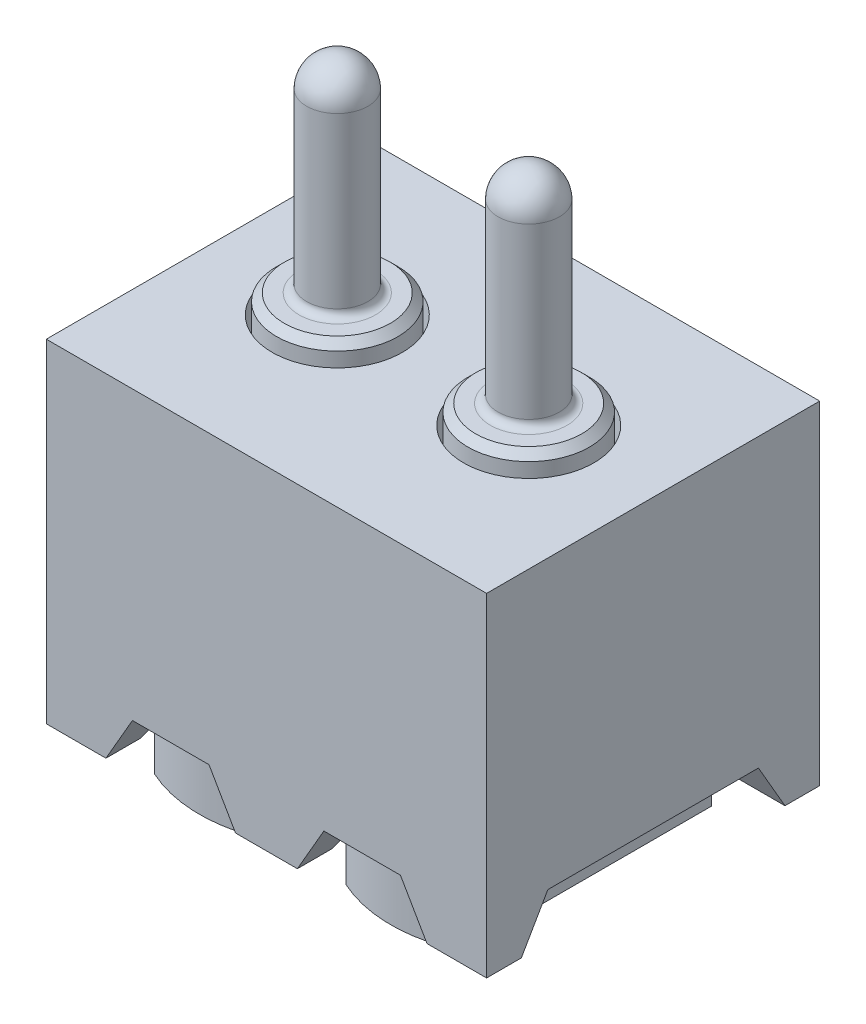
ISO-10303-21;
HEADER;
FILE_DESCRIPTION(('STEP AP214'),'2;1');
FILE_NAME('part.step','',(''),(''),'','','');
FILE_SCHEMA(('AUTOMOTIVE_DESIGN { 1 0 10303 214 1 1 1 1 }'));
ENDSEC;
DATA;
#1=APPLICATION_CONTEXT('core data for automotive mechanical design processes');
#2=APPLICATION_PROTOCOL_DEFINITION('international standard','automotive_design',2000,#1);
#3=PRODUCT_CONTEXT('',#1,'mechanical');
#4=PRODUCT('Part','Part','',(#3));
#5=PRODUCT_RELATED_PRODUCT_CATEGORY('part','',(#4));
#6=PRODUCT_DEFINITION_FORMATION('','',#4);
#7=PRODUCT_DEFINITION_CONTEXT('part definition',#1,'design');
#8=PRODUCT_DEFINITION('design','',#6,#7);
#9=PRODUCT_DEFINITION_SHAPE('','',#8);
#10=(LENGTH_UNIT() NAMED_UNIT(*) SI_UNIT(.MILLI.,.METRE.));
#11=(NAMED_UNIT(*) PLANE_ANGLE_UNIT() SI_UNIT($,.RADIAN.));
#12=(NAMED_UNIT(*) SI_UNIT($,.STERADIAN.) SOLID_ANGLE_UNIT());
#13=UNCERTAINTY_MEASURE_WITH_UNIT(LENGTH_MEASURE(1.E-05),#10,'distance_accuracy_value','');
#14=(GEOMETRIC_REPRESENTATION_CONTEXT(3) GLOBAL_UNCERTAINTY_ASSIGNED_CONTEXT((#13)) GLOBAL_UNIT_ASSIGNED_CONTEXT((#10,
#11,#12)) REPRESENTATION_CONTEXT('',''));
#15=CARTESIAN_POINT('',(0.,0.,0.));
#16=DIRECTION('',(0.,0.,1.));
#17=DIRECTION('',(1.,0.,0.));
#18=AXIS2_PLACEMENT_3D('',#15,#16,#17);
#19=CARTESIAN_POINT('',(1.71449999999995,-1.905,0.1651));
#20=DIRECTION('',(1.,0.,0.));
#21=DIRECTION('',(0.,1.,0.));
#22=AXIS2_PLACEMENT_3D('',#19,#20,#21);
#23=PLANE('',#22);
#24=CARTESIAN_POINT('',(2.09549999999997,-1.90499999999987,-1.10489999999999));
#25=DIRECTION('',(0.,1.,0.));
#26=DIRECTION('',(-0.946372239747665,0.,-0.323078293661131));
#27=AXIS2_PLACEMENT_3D('',#24,#25,#26);
#28=CIRCLE('',#27,0.402590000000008);
#29=CARTESIAN_POINT('',(1.71449999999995,-1.905,-1.23496809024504));
#30=VERTEX_POINT('',#29);
#31=CARTESIAN_POINT('',(1.71449999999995,-1.905,-0.974831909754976));
#32=VERTEX_POINT('',#31);
#33=EDGE_CURVE('P0_E103',#30,#32,#28,.T.);
#34=ORIENTED_EDGE('',*,*,#33,.F.);
#35=DIRECTION('',(0.,0.,1.));
#36=VECTOR('',#35,1.);
#37=CARTESIAN_POINT('',(1.71449999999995,-1.905,0.1651));
#38=LINE('',#37,#36);
#39=CARTESIAN_POINT('',(1.71449999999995,-1.90499999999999,-1.93614386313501));
#40=VERTEX_POINT('',#39);
#41=EDGE_CURVE('P0_E101',#40,#30,#38,.T.);
#42=ORIENTED_EDGE('',*,*,#41,.F.);
#43=DIRECTION('',(0.,-1.,0.));
#44=VECTOR('',#43,1.);
#45=CARTESIAN_POINT('',(1.71449999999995,-2.413,-1.93614386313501));
#46=LINE('',#45,#44);
#47=CARTESIAN_POINT('',(1.71449999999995,-2.413,-1.93614386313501));
#48=VERTEX_POINT('',#47);
#49=EDGE_CURVE('P0_E96',#48,#40,#46,.F.);
#50=ORIENTED_EDGE('',*,*,#49,.F.);
#51=DIRECTION('',(0.,0.,1.));
#52=VECTOR('',#51,1.);
#53=CARTESIAN_POINT('',(1.71449999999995,-2.413,-2.01929999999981));
#54=LINE('',#53,#52);
#55=CARTESIAN_POINT('',(1.71449999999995,-2.413,-0.273656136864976));
#56=VERTEX_POINT('',#55);
#57=EDGE_CURVE('P0_E87',#48,#56,#54,.T.);
#58=ORIENTED_EDGE('',*,*,#57,.T.);
#59=DIRECTION('',(0.,1.,0.));
#60=VECTOR('',#59,1.);
#61=CARTESIAN_POINT('',(1.71449999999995,-1.905,-0.273656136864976));
#62=LINE('',#61,#60);
#63=CARTESIAN_POINT('',(1.71449999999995,-1.905,-0.273656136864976));
#64=VERTEX_POINT('',#63);
#65=EDGE_CURVE('P0_E99',#64,#56,#62,.F.);
#66=ORIENTED_EDGE('',*,*,#65,.F.);
#67=DIRECTION('',(0.,0.,1.));
#68=VECTOR('',#67,1.);
#69=CARTESIAN_POINT('',(1.71449999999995,-1.905,0.1651));
#70=LINE('',#69,#68);
#71=EDGE_CURVE('P0_E98',#32,#64,#70,.T.);
#72=ORIENTED_EDGE('',*,*,#71,.F.);
#73=EDGE_LOOP('',(#34,#42,#50,#58,#66,#72));
#74=FACE_BOUND('',#73,.T.);
#75=ADVANCED_FACE('P0_F16',(#74),#23,.F.);
#76=CARTESIAN_POINT('',(2.09549999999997,-2.41299999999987,-1.10489999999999));
#77=DIRECTION('',(0.,-1.,0.));
#78=DIRECTION('',(1.,0.,0.));
#79=AXIS2_PLACEMENT_3D('',#76,#77,#78);
#80=CYLINDRICAL_SURFACE('',#79,0.914399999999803);
#81=CARTESIAN_POINT('',(2.09549999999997,-2.41299999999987,-1.10489999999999));
#82=DIRECTION('',(0.,-1.,0.));
#83=DIRECTION('',(1.,0.,0.));
#84=AXIS2_PLACEMENT_3D('',#81,#82,#83);
#85=CIRCLE('',#84,0.914399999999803);
#86=CARTESIAN_POINT('',(2.47649999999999,-2.41299999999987,-1.93614386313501));
#87=VERTEX_POINT('',#86);
#88=EDGE_CURVE('P0_E20',#87,#48,#85,.F.);
#89=ORIENTED_EDGE('',*,*,#88,.T.);
#90=ORIENTED_EDGE('',*,*,#49,.T.);
#91=CARTESIAN_POINT('',(2.09549999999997,-1.90499999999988,-1.10489999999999));
#92=DIRECTION('',(0.,-1.,0.));
#93=DIRECTION('',(1.,0.,0.));
#94=AXIS2_PLACEMENT_3D('',#91,#92,#93);
#95=CIRCLE('',#94,0.914399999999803);
#96=CARTESIAN_POINT('',(2.47650000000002,-1.90499999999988,-1.93614386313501));
#97=VERTEX_POINT('',#96);
#98=EDGE_CURVE('P0_E74',#40,#97,#95,.T.);
#99=ORIENTED_EDGE('',*,*,#98,.T.);
#100=DIRECTION('',(0.,-1.,0.));
#101=VECTOR('',#100,1.);
#102=CARTESIAN_POINT('',(2.47650000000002,-1.90499999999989,-1.93614386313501));
#103=LINE('',#102,#101);
#104=EDGE_CURVE('P0_E68',#97,#87,#103,.T.);
#105=ORIENTED_EDGE('',*,*,#104,.T.);
#106=EDGE_LOOP('',(#89,#90,#99,#105));
#107=FACE_BOUND('',#106,.T.);
#108=ADVANCED_FACE('P0_F70',(#107),#80,.T.);
#109=CARTESIAN_POINT('',(2.09549999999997,-2.41299999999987,-2.01929999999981));
#110=DIRECTION('',(0.,1.,0.));
#111=DIRECTION('',(-1.,0.,0.));
#112=AXIS2_PLACEMENT_3D('',#109,#110,#111);
#113=PLANE('',#112);
#114=DIRECTION('',(0.,0.,1.));
#115=VECTOR('',#114,1.);
#116=CARTESIAN_POINT('',(2.47649999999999,-2.41299999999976,0.1651));
#117=LINE('',#116,#115);
#118=CARTESIAN_POINT('',(2.47649999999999,-2.41299999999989,-0.273656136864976));
#119=VERTEX_POINT('',#118);
#120=EDGE_CURVE('P0_E79',#87,#119,#117,.T.);
#121=ORIENTED_EDGE('',*,*,#120,.T.);
#122=CARTESIAN_POINT('',(2.09549999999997,-2.41299999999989,-1.10489999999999));
#123=DIRECTION('',(0.,-1.,0.));
#124=DIRECTION('',(1.,0.,0.));
#125=AXIS2_PLACEMENT_3D('',#122,#123,#124);
#126=CIRCLE('',#125,0.914399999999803);
#127=EDGE_CURVE('P0_E88',#56,#119,#126,.F.);
#128=ORIENTED_EDGE('',*,*,#127,.F.);
#129=ORIENTED_EDGE('',*,*,#57,.F.);
#130=ORIENTED_EDGE('',*,*,#88,.F.);
#131=EDGE_LOOP('',(#121,#128,#129,#130));
#132=FACE_BOUND('',#131,.T.);
#133=ADVANCED_FACE('P0_F83',(#132),#113,.F.);
#134=CARTESIAN_POINT('',(2.09549999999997,-2.41299999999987,-1.10489999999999));
#135=DIRECTION('',(0.,-1.,0.));
#136=DIRECTION('',(1.,0.,0.));
#137=AXIS2_PLACEMENT_3D('',#134,#135,#136);
#138=CYLINDRICAL_SURFACE('',#137,0.914399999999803);
#139=CARTESIAN_POINT('',(2.09549999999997,-1.90499999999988,-1.10489999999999));
#140=DIRECTION('',(0.,-1.,0.));
#141=DIRECTION('',(1.,0.,0.));
#142=AXIS2_PLACEMENT_3D('',#139,#140,#141);
#143=CIRCLE('',#142,0.914399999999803);
#144=CARTESIAN_POINT('',(2.47649999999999,-1.90499999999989,-0.273656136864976));
#145=VERTEX_POINT('',#144);
#146=EDGE_CURVE('P0_E80',#145,#64,#143,.T.);
#147=ORIENTED_EDGE('',*,*,#146,.T.);
#148=ORIENTED_EDGE('',*,*,#65,.T.);
#149=ORIENTED_EDGE('',*,*,#127,.T.);
#150=DIRECTION('',(0.,-1.,0.));
#151=VECTOR('',#150,1.);
#152=CARTESIAN_POINT('',(2.47649999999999,-1.90499999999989,-0.273656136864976));
#153=LINE('',#152,#151);
#154=EDGE_CURVE('P0_E91',#119,#145,#153,.F.);
#155=ORIENTED_EDGE('',*,*,#154,.T.);
#156=EDGE_LOOP('',(#147,#148,#149,#155));
#157=FACE_BOUND('',#156,.T.);
#158=ADVANCED_FACE('P0_F186',(#157),#138,.T.);
#159=CARTESIAN_POINT('',(2.09550000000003,1.29677440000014,-1.10489999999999));
#160=DIRECTION('',(1.,0.,0.));
#161=DIRECTION('',(0.,0.,-1.));
#162=AXIS2_PLACEMENT_3D('',#159,#160,#161);
#163=SPHERICAL_SURFACE('',#162,0.203225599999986);
#164=CARTESIAN_POINT('',(2.09550000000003,1.30000000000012,-1.10489999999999));
#165=DIRECTION('',(0.,-1.,0.));
#166=DIRECTION('',(1.,0.,0.));
#167=AXIS2_PLACEMENT_3D('',#164,#165,#166);
#168=CIRCLE('',#167,0.203199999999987);
#169=CARTESIAN_POINT('',(2.29870000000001,1.30000000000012,-1.10489999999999));
#170=VERTEX_POINT('',#169);
#171=EDGE_CURVE('P0_E194',#170,#170,#168,.T.);
#172=ORIENTED_EDGE('',*,*,#171,.F.);
#173=EDGE_LOOP('',(#172));
#174=FACE_BOUND('',#173,.T.);
#175=ADVANCED_FACE('P0_F181',(#174),#163,.T.);
#176=CARTESIAN_POINT('',(2.0955,-1.90499999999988,-1.50749));
#177=DIRECTION('',(0.,-1.,0.));
#178=DIRECTION('',(1.,0.,0.));
#179=AXIS2_PLACEMENT_3D('',#176,#177,#178);
#180=PLANE('',#179);
#181=DIRECTION('',(0.,0.,1.));
#182=VECTOR('',#181,1.);
#183=CARTESIAN_POINT('',(2.47649999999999,-1.90499999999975,0.1651));
#184=LINE('',#183,#182);
#185=CARTESIAN_POINT('',(2.47649999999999,-1.90499999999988,-1.23496809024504));
#186=VERTEX_POINT('',#185);
#187=EDGE_CURVE('P0_E193',#186,#97,#184,.F.);
#188=ORIENTED_EDGE('',*,*,#187,.T.);
#189=ORIENTED_EDGE('',*,*,#98,.F.);
#190=ORIENTED_EDGE('',*,*,#41,.T.);
#191=CARTESIAN_POINT('',(2.09549999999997,-1.90499999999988,-1.10489999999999));
#192=DIRECTION('',(0.,-1.,0.));
#193=DIRECTION('',(1.,0.,0.));
#194=AXIS2_PLACEMENT_3D('',#191,#192,#193);
#195=CIRCLE('',#194,0.402590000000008);
#196=EDGE_CURVE('P0_E197',#186,#30,#195,.F.);
#197=ORIENTED_EDGE('',*,*,#196,.F.);
#198=EDGE_LOOP('',(#188,#189,#190,#197));
#199=FACE_BOUND('',#198,.T.);
#200=ADVANCED_FACE('P0_F178',(#199),#180,.F.);
#201=CARTESIAN_POINT('',(2.0955,-1.90499999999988,-1.50749));
#202=DIRECTION('',(0.,-1.,0.));
#203=DIRECTION('',(1.,0.,0.));
#204=AXIS2_PLACEMENT_3D('',#201,#202,#203);
#205=PLANE('',#204);
#206=DIRECTION('',(0.,0.,1.));
#207=VECTOR('',#206,1.);
#208=CARTESIAN_POINT('',(2.47649999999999,-1.90499999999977,0.1651));
#209=LINE('',#208,#207);
#210=CARTESIAN_POINT('',(2.47649999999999,-1.90499999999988,-0.974831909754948));
#211=VERTEX_POINT('',#210);
#212=EDGE_CURVE('P0_E35',#145,#211,#209,.F.);
#213=ORIENTED_EDGE('',*,*,#212,.T.);
#214=CARTESIAN_POINT('',(2.09549999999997,-1.90499999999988,-1.10489999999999));
#215=DIRECTION('',(0.,-1.,0.));
#216=DIRECTION('',(1.,0.,0.));
#217=AXIS2_PLACEMENT_3D('',#214,#215,#216);
#218=CIRCLE('',#217,0.402590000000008);
#219=EDGE_CURVE('P0_E201',#32,#211,#218,.F.);
#220=ORIENTED_EDGE('',*,*,#219,.F.);
#221=ORIENTED_EDGE('',*,*,#71,.T.);
#222=ORIENTED_EDGE('',*,*,#146,.F.);
#223=EDGE_LOOP('',(#213,#220,#221,#222));
#224=FACE_BOUND('',#223,.T.);
#225=ADVANCED_FACE('P0_F175',(#224),#205,.F.);
#226=CARTESIAN_POINT('',(2.47649999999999,-1.90499999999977,0.1651));
#227=DIRECTION('',(-1.,0.,0.));
#228=DIRECTION('',(0.,-1.,0.));
#229=AXIS2_PLACEMENT_3D('',#226,#227,#228);
#230=PLANE('',#229);
#231=CARTESIAN_POINT('',(2.09549999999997,-1.90499999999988,-1.10489999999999));
#232=DIRECTION('',(0.,1.,0.));
#233=DIRECTION('',(0.946372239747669,0.,0.323078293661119));
#234=AXIS2_PLACEMENT_3D('',#231,#232,#233);
#235=CIRCLE('',#234,0.402590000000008);
#236=EDGE_CURVE('P0_E162',#211,#186,#235,.T.);
#237=ORIENTED_EDGE('',*,*,#236,.F.);
#238=ORIENTED_EDGE('',*,*,#212,.F.);
#239=ORIENTED_EDGE('',*,*,#154,.F.);
#240=ORIENTED_EDGE('',*,*,#120,.F.);
#241=ORIENTED_EDGE('',*,*,#104,.F.);
#242=ORIENTED_EDGE('',*,*,#187,.F.);
#243=EDGE_LOOP('',(#237,#238,#239,#240,#241,#242));
#244=FACE_BOUND('',#243,.T.);
#245=ADVANCED_FACE('P0_F90',(#244),#230,.F.);
#246=CARTESIAN_POINT('',(2.09549999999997,-2.41299999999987,-1.10489999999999));
#247=DIRECTION('',(0.,-1.,0.));
#248=DIRECTION('',(1.,0.,0.));
#249=AXIS2_PLACEMENT_3D('',#246,#247,#248);
#250=CYLINDRICAL_SURFACE('',#249,0.203199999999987);
#251=CARTESIAN_POINT('',(2.0955,0.177800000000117,-1.10489999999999));
#252=DIRECTION('',(0.,-1.,0.));
#253=DIRECTION('',(-1.,0.,0.));
#254=AXIS2_PLACEMENT_3D('',#251,#252,#253);
#255=CIRCLE('',#254,0.203199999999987);
#256=CARTESIAN_POINT('',(1.89230000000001,0.177800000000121,-1.10489999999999));
#257=VERTEX_POINT('',#256);
#258=EDGE_CURVE('P0_E211',#257,#257,#255,.F.);
#259=ORIENTED_EDGE('',*,*,#258,.T.);
#260=EDGE_LOOP('',(#259));
#261=FACE_BOUND('',#260,.T.);
#262=ORIENTED_EDGE('',*,*,#171,.T.);
#263=EDGE_LOOP('',(#262));
#264=FACE_BOUND('',#263,.T.);
#265=ADVANCED_FACE('P0_F142',(#261,#264),#250,.T.);
#266=CARTESIAN_POINT('',(2.09549999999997,-2.41299999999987,-1.10489999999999));
#267=DIRECTION('',(0.,-1.,0.));
#268=DIRECTION('',(1.,0.,0.));
#269=AXIS2_PLACEMENT_3D('',#266,#267,#268);
#270=CYLINDRICAL_SURFACE('',#269,0.402590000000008);
#271=CARTESIAN_POINT('',(2.0955,-1.09219999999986,-1.10489999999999));
#272=DIRECTION('',(0.,-1.,0.));
#273=DIRECTION('',(1.,0.,0.));
#274=AXIS2_PLACEMENT_3D('',#271,#272,#273);
#275=CIRCLE('',#274,0.402590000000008);
#276=CARTESIAN_POINT('',(2.49809000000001,-1.09219999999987,-1.10489999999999));
#277=VERTEX_POINT('',#276);
#278=EDGE_CURVE('P0_E213',#277,#277,#275,.T.);
#279=ORIENTED_EDGE('',*,*,#278,.T.);
#280=EDGE_LOOP('',(#279));
#281=FACE_BOUND('',#280,.T.);
#282=ORIENTED_EDGE('',*,*,#219,.T.);
#283=ORIENTED_EDGE('',*,*,#236,.T.);
#284=ORIENTED_EDGE('',*,*,#196,.T.);
#285=ORIENTED_EDGE('',*,*,#33,.T.);
#286=EDGE_LOOP('',(#282,#283,#284,#285));
#287=FACE_BOUND('',#286,.T.);
#288=ADVANCED_FACE('P0_F131',(#281,#287),#270,.T.);
#289=CARTESIAN_POINT('',(2.0955,0.177799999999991,-1.10489999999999));
#290=DIRECTION('',(0.,-1.,0.));
#291=DIRECTION('',(-1.,0.,0.));
#292=AXIS2_PLACEMENT_3D('',#289,#290,#291);
#293=TOROIDAL_SURFACE('',#292,0.253999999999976,0.0507999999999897);
#294=ORIENTED_EDGE('',*,*,#258,.F.);
#295=EDGE_LOOP('',(#294));
#296=FACE_BOUND('',#295,.T.);
#297=CARTESIAN_POINT('',(2.0955,0.127000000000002,-1.10489999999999));
#298=DIRECTION('',(0.,1.,0.));
#299=DIRECTION('',(-1.,0.,0.));
#300=AXIS2_PLACEMENT_3D('',#297,#298,#299);
#301=CIRCLE('',#300,0.253999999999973);
#302=CARTESIAN_POINT('',(1.84150000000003,0.127000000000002,-1.10489999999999));
#303=VERTEX_POINT('',#302);
#304=EDGE_CURVE('P0_E220',#303,#303,#301,.T.);
#305=ORIENTED_EDGE('',*,*,#304,.T.);
#306=EDGE_LOOP('',(#305));
#307=FACE_BOUND('',#306,.T.);
#308=ADVANCED_FACE('P0_F141',(#296,#307),#293,.F.);
#309=CARTESIAN_POINT('',(2.0955,-1.09219999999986,-1.50749));
#310=DIRECTION('',(0.,1.,0.));
#311=DIRECTION('',(-1.,0.,0.));
#312=AXIS2_PLACEMENT_3D('',#309,#310,#311);
#313=PLANE('',#312);
#314=CARTESIAN_POINT('',(2.0955,-1.09220000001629,-1.10489999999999));
#315=DIRECTION('',(0.,-1.,0.));
#316=DIRECTION('',(1.,0.,0.));
#317=AXIS2_PLACEMENT_3D('',#314,#315,#316);
#318=CIRCLE('',#317,0.440690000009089);
#319=CARTESIAN_POINT('',(2.53619000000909,-1.0922000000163,-1.10489999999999));
#320=VERTEX_POINT('',#319);
#321=EDGE_CURVE('P0_E221',#320,#320,#318,.F.);
#322=ORIENTED_EDGE('',*,*,#321,.F.);
#323=EDGE_LOOP('',(#322));
#324=FACE_BOUND('',#323,.T.);
#325=ORIENTED_EDGE('',*,*,#278,.F.);
#326=EDGE_LOOP('',(#325));
#327=FACE_BOUND('',#326,.T.);
#328=ADVANCED_FACE('P0_F257',(#324,#327),#313,.F.);
#329=CARTESIAN_POINT('',(2.0955,0.127000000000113,-1.45669000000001));
#330=DIRECTION('',(0.,-1.,0.));
#331=DIRECTION('',(1.,0.,0.));
#332=AXIS2_PLACEMENT_3D('',#329,#330,#331);
#333=PLANE('',#332);
#334=ORIENTED_EDGE('',*,*,#304,.F.);
#335=EDGE_LOOP('',(#334));
#336=FACE_BOUND('',#335,.T.);
#337=CARTESIAN_POINT('',(2.0955,0.127000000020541,-1.10489999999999));
#338=DIRECTION('',(0.,-1.,0.));
#339=DIRECTION('',(1.,0.,0.));
#340=AXIS2_PLACEMENT_3D('',#337,#338,#339);
#341=CIRCLE('',#340,0.351789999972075);
#342=CARTESIAN_POINT('',(2.44728999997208,0.127000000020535,-1.10489999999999));
#343=VERTEX_POINT('',#342);
#344=EDGE_CURVE('P0_E129',#343,#343,#341,.T.);
#345=ORIENTED_EDGE('',*,*,#344,.F.);
#346=EDGE_LOOP('',(#345));
#347=FACE_BOUND('',#346,.T.);
#348=ADVANCED_FACE('P0_F247',(#336,#347),#333,.F.);
#349=CARTESIAN_POINT('',(2.0955,-1.09220000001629,-1.10489999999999));
#350=DIRECTION('',(0.,-1.,0.));
#351=DIRECTION('',(1.,0.,0.));
#352=AXIS2_PLACEMENT_3D('',#349,#350,#351);
#353=CONICAL_SURFACE('',#352,0.440690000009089,0.261799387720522);
#354=CARTESIAN_POINT('',(2.0955,-0.950008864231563,-1.10489999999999));
#355=DIRECTION('',(0.,-1.,0.));
#356=DIRECTION('',(1.,0.,0.));
#357=AXIS2_PLACEMENT_3D('',#354,#355,#356);
#358=CIRCLE('',#357,0.402590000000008);
#359=CARTESIAN_POINT('',(2.49809000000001,-0.950008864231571,-1.10489999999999));
#360=VERTEX_POINT('',#359);
#361=EDGE_CURVE('P0_E26',#360,#360,#358,.F.);
#362=ORIENTED_EDGE('',*,*,#361,.F.);
#363=EDGE_LOOP('',(#362));
#364=FACE_BOUND('',#363,.T.);
#365=ORIENTED_EDGE('',*,*,#321,.T.);
#366=EDGE_LOOP('',(#365));
#367=FACE_BOUND('',#366,.T.);
#368=ADVANCED_FACE('P0_F256',(#364,#367),#353,.T.);
#369=CARTESIAN_POINT('',(2.0955,0.0761999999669,-1.10489999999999));
#370=DIRECTION('',(0.,-1.,0.));
#371=DIRECTION('',(1.,0.,0.));
#372=AXIS2_PLACEMENT_3D('',#369,#370,#371);
#373=CONICAL_SURFACE('',#372,0.402590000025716,0.785398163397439);
#374=ORIENTED_EDGE('',*,*,#344,.T.);
#375=EDGE_LOOP('',(#374));
#376=FACE_BOUND('',#375,.T.);
#377=CARTESIAN_POINT('',(2.0955,0.0762000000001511,-1.10489999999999));
#378=DIRECTION('',(0.,-1.,0.));
#379=DIRECTION('',(1.,0.,0.));
#380=AXIS2_PLACEMENT_3D('',#377,#378,#379);
#381=CIRCLE('',#380,0.402590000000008);
#382=CARTESIAN_POINT('',(2.49809000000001,0.0762000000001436,-1.10489999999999));
#383=VERTEX_POINT('',#382);
#384=EDGE_CURVE('P0_E11',#383,#383,#381,.T.);
#385=ORIENTED_EDGE('',*,*,#384,.F.);
#386=EDGE_LOOP('',(#385));
#387=FACE_BOUND('',#386,.T.);
#388=ADVANCED_FACE('P0_F269',(#376,#387),#373,.T.);
#389=CARTESIAN_POINT('',(2.09549999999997,-2.41299999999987,-1.10489999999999));
#390=DIRECTION('',(0.,-1.,0.));
#391=DIRECTION('',(1.,0.,0.));
#392=AXIS2_PLACEMENT_3D('',#389,#390,#391);
#393=CYLINDRICAL_SURFACE('',#392,0.402590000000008);
#394=ORIENTED_EDGE('',*,*,#384,.T.);
#395=EDGE_LOOP('',(#394));
#396=FACE_BOUND('',#395,.T.);
#397=ORIENTED_EDGE('',*,*,#361,.T.);
#398=EDGE_LOOP('',(#397));
#399=FACE_BOUND('',#398,.T.);
#400=ADVANCED_FACE('P0_F267',(#396,#399),#393,.T.);
#401=CLOSED_SHELL('',(#75,#108,#133,#158,#175,#200,#225,#245,#265,#288,#308,#328,#348,#368,#388,#400));
#402=MANIFOLD_SOLID_BREP('P0_B1',#401);
#403=CARTESIAN_POINT('',(0.,-2.2098,0.));
#404=DIRECTION('',(0.,1.,0.));
#405=DIRECTION('',(-1.,0.,0.));
#406=AXIS2_PLACEMENT_3D('',#403,#404,#405);
#407=PLANE('',#406);
#408=DIRECTION('',(0.,0.,1.));
#409=VECTOR('',#408,1.);
#410=CARTESIAN_POINT('',(1.665523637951,-2.2098,-2.20980000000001));
#411=LINE('',#410,#409);
#412=CARTESIAN_POINT('',(1.665523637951,-2.2098,-2.20980000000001));
#413=VERTEX_POINT('',#412);
#414=CARTESIAN_POINT('',(1.665523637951,-2.2098,-1.97937636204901));
#415=VERTEX_POINT('',#414);
#416=EDGE_CURVE('P1_E175',#413,#415,#411,.T.);
#417=ORIENTED_EDGE('',*,*,#416,.T.);
#418=DIRECTION('',(1.,0.,0.));
#419=VECTOR('',#418,1.);
#420=CARTESIAN_POINT('',(-60.96,-2.20979999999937,-1.97937636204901));
#421=LINE('',#420,#419);
#422=CARTESIAN_POINT('',(1.255476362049,-2.20979999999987,-1.97937636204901));
#423=VERTEX_POINT('',#422);
#424=EDGE_CURVE('P1_E190',#415,#423,#421,.F.);
#425=ORIENTED_EDGE('',*,*,#424,.T.);
#426=DIRECTION('',(0.,0.,1.));
#427=VECTOR('',#426,1.);
#428=CARTESIAN_POINT('',(1.255476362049,-2.20979999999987,-2.20979999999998));
#429=LINE('',#428,#427);
#430=CARTESIAN_POINT('',(1.255476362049,-2.20979999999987,-2.20979999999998));
#431=VERTEX_POINT('',#430);
#432=EDGE_CURVE('P1_E180',#423,#431,#429,.F.);
#433=ORIENTED_EDGE('',*,*,#432,.T.);
#434=DIRECTION('',(-1.,0.,0.));
#435=VECTOR('',#434,1.);
#436=CARTESIAN_POINT('',(2.921,-2.20979999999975,-2.20980000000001));
#437=LINE('',#436,#435);
#438=EDGE_CURVE('P1_E243',#413,#431,#437,.T.);
#439=ORIENTED_EDGE('',*,*,#438,.F.);
#440=EDGE_LOOP('',(#417,#425,#433,#439));
#441=FACE_BOUND('',#440,.T.);
#442=ADVANCED_FACE('P1_F16',(#441),#407,.F.);
#443=CARTESIAN_POINT('',(1.255476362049,-2.20979999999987,-2.20979999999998));
#444=DIRECTION('',(0.866025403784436,0.49999999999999,0.));
#445=DIRECTION('',(-0.500000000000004,0.866025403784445,0.));
#446=AXIS2_PLACEMENT_3D('',#443,#444,#445);
#447=PLANE('',#446);
#448=DIRECTION('',(-0.500000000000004,0.866025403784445,0.));
#449=VECTOR('',#448,1.);
#450=CARTESIAN_POINT('',(1.255476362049,-2.20979999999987,-2.20979999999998));
#451=LINE('',#450,#449);
#452=CARTESIAN_POINT('',(1.07950000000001,-1.90499999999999,-2.20980000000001));
#453=VERTEX_POINT('',#452);
#454=EDGE_CURVE('P1_E186',#431,#453,#451,.T.);
#455=ORIENTED_EDGE('',*,*,#454,.F.);
#456=ORIENTED_EDGE('',*,*,#432,.F.);
#457=DIRECTION('',(-0.447213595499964,0.774596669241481,0.447213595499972));
#458=VECTOR('',#457,1.);
#459=CARTESIAN_POINT('',(1.255476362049,-2.20979999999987,-1.97937636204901));
#460=LINE('',#459,#458);
#461=CARTESIAN_POINT('',(1.07950000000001,-1.90499999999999,-1.80339999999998));
#462=VERTEX_POINT('',#461);
#463=EDGE_CURVE('P1_E183',#423,#462,#460,.T.);
#464=ORIENTED_EDGE('',*,*,#463,.T.);
#465=DIRECTION('',(0.,0.,1.));
#466=VECTOR('',#465,1.);
#467=CARTESIAN_POINT('',(1.07950000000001,-1.90499999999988,-0.406400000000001));
#468=LINE('',#467,#466);
#469=EDGE_CURVE('P1_E213',#462,#453,#468,.F.);
#470=ORIENTED_EDGE('',*,*,#469,.T.);
#471=EDGE_LOOP('',(#455,#456,#464,#470));
#472=FACE_BOUND('',#471,.T.);
#473=ADVANCED_FACE('P1_F181',(#472),#447,.F.);
#474=CARTESIAN_POINT('',(0.395523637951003,-2.2098,-2.20979999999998));
#475=DIRECTION('',(-0.866025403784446,0.500000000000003,0.));
#476=DIRECTION('',(-0.499999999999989,-0.866025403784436,0.));
#477=AXIS2_PLACEMENT_3D('',#474,#475,#476);
#478=PLANE('',#477);
#479=DIRECTION('',(-0.49999999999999,-0.866025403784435,0.));
#480=VECTOR('',#479,1.);
#481=CARTESIAN_POINT('',(0.571500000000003,-1.90499999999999,-2.20980000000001));
#482=LINE('',#481,#480);
#483=CARTESIAN_POINT('',(0.571500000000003,-1.90499999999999,-2.20980000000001));
#484=VERTEX_POINT('',#483);
#485=CARTESIAN_POINT('',(0.395523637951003,-2.2098,-2.20979999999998));
#486=VERTEX_POINT('',#485);
#487=EDGE_CURVE('P1_E239',#484,#486,#482,.T.);
#488=ORIENTED_EDGE('',*,*,#487,.F.);
#489=DIRECTION('',(0.,0.,1.));
#490=VECTOR('',#489,1.);
#491=CARTESIAN_POINT('',(0.571500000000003,-1.905,-0.406400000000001));
#492=LINE('',#491,#490);
#493=CARTESIAN_POINT('',(0.571500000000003,-1.90499999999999,-1.80339999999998));
#494=VERTEX_POINT('',#493);
#495=EDGE_CURVE('P1_E298',#484,#494,#492,.T.);
#496=ORIENTED_EDGE('',*,*,#495,.T.);
#497=DIRECTION('',(-0.44721359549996,-0.774596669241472,-0.447213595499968));
#498=VECTOR('',#497,1.);
#499=CARTESIAN_POINT('',(0.571500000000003,-1.90499999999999,-1.80339999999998));
#500=LINE('',#499,#498);
#501=CARTESIAN_POINT('',(0.395523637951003,-2.2098,-1.97937636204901));
#502=VERTEX_POINT('',#501);
#503=EDGE_CURVE('P1_E222',#494,#502,#500,.T.);
#504=ORIENTED_EDGE('',*,*,#503,.T.);
#505=DIRECTION('',(0.,0.,1.));
#506=VECTOR('',#505,1.);
#507=CARTESIAN_POINT('',(0.395523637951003,-2.2098,0.));
#508=LINE('',#507,#506);
#509=EDGE_CURVE('P1_E234',#502,#486,#508,.F.);
#510=ORIENTED_EDGE('',*,*,#509,.T.);
#511=EDGE_LOOP('',(#488,#496,#504,#510));
#512=FACE_BOUND('',#511,.T.);
#513=ADVANCED_FACE('P1_F310',(#512),#478,.F.);
#514=CARTESIAN_POINT('',(2.525476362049,-2.20979999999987,-2.20980000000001));
#515=DIRECTION('',(0.866025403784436,0.49999999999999,0.));
#516=DIRECTION('',(-0.500000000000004,0.866025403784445,0.));
#517=AXIS2_PLACEMENT_3D('',#514,#515,#516);
#518=PLANE('',#517);
#519=DIRECTION('',(-0.500000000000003,0.866025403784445,0.));
#520=VECTOR('',#519,1.);
#521=CARTESIAN_POINT('',(2.525476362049,-2.20979999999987,-2.20980000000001));
#522=LINE('',#521,#520);
#523=CARTESIAN_POINT('',(2.525476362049,-2.20979999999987,-2.20980000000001));
#524=VERTEX_POINT('',#523);
#525=CARTESIAN_POINT('',(2.3495,-1.90499999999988,-2.20980000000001));
#526=VERTEX_POINT('',#525);
#527=EDGE_CURVE('P1_E248',#524,#526,#522,.T.);
#528=ORIENTED_EDGE('',*,*,#527,.F.);
#529=DIRECTION('',(0.,0.,1.));
#530=VECTOR('',#529,1.);
#531=CARTESIAN_POINT('',(2.525476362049,-2.20979999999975,0.));
#532=LINE('',#531,#530);
#533=CARTESIAN_POINT('',(2.525476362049,-2.20979999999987,-1.97937636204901));
#534=VERTEX_POINT('',#533);
#535=EDGE_CURVE('P1_E253',#524,#534,#532,.T.);
#536=ORIENTED_EDGE('',*,*,#535,.T.);
#537=DIRECTION('',(-0.447213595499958,0.774596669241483,0.447213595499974));
#538=VECTOR('',#537,1.);
#539=CARTESIAN_POINT('',(2.525476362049,-2.20979999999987,-1.97937636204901));
#540=LINE('',#539,#538);
#541=CARTESIAN_POINT('',(2.3495,-1.90499999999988,-1.80339999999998));
#542=VERTEX_POINT('',#541);
#543=EDGE_CURVE('P1_E193',#534,#542,#540,.T.);
#544=ORIENTED_EDGE('',*,*,#543,.T.);
#545=DIRECTION('',(0.,0.,1.));
#546=VECTOR('',#545,1.);
#547=CARTESIAN_POINT('',(2.3495,-1.90499999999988,-0.406400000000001));
#548=LINE('',#547,#546);
#549=EDGE_CURVE('P1_E260',#542,#526,#548,.F.);
#550=ORIENTED_EDGE('',*,*,#549,.T.);
#551=EDGE_LOOP('',(#528,#536,#544,#550));
#552=FACE_BOUND('',#551,.T.);
#553=ADVANCED_FACE('P1_F258',(#552),#518,.F.);
#554=CARTESIAN_POINT('',(1.665523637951,-2.2098,-2.20980000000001));
#555=DIRECTION('',(-0.866025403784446,0.500000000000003,0.));
#556=DIRECTION('',(-0.499999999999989,-0.866025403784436,0.));
#557=AXIS2_PLACEMENT_3D('',#554,#555,#556);
#558=PLANE('',#557);
#559=DIRECTION('',(-0.49999999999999,-0.866025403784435,0.));
#560=VECTOR('',#559,1.);
#561=CARTESIAN_POINT('',(1.84149999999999,-1.905,-2.20980000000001));
#562=LINE('',#561,#560);
#563=CARTESIAN_POINT('',(1.84149999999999,-1.905,-2.20980000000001));
#564=VERTEX_POINT('',#563);
#565=EDGE_CURVE('P1_E245',#564,#413,#562,.T.);
#566=ORIENTED_EDGE('',*,*,#565,.F.);
#567=DIRECTION('',(0.,0.,1.));
#568=VECTOR('',#567,1.);
#569=CARTESIAN_POINT('',(1.8415,-1.905,-0.406400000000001));
#570=LINE('',#569,#568);
#571=CARTESIAN_POINT('',(1.84149999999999,-1.905,-1.80339999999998));
#572=VERTEX_POINT('',#571);
#573=EDGE_CURVE('P1_E281',#564,#572,#570,.T.);
#574=ORIENTED_EDGE('',*,*,#573,.T.);
#575=DIRECTION('',(-0.447213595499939,-0.774596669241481,-0.447213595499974));
#576=VECTOR('',#575,1.);
#577=CARTESIAN_POINT('',(1.84149999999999,-1.905,-1.80339999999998));
#578=LINE('',#577,#576);
#579=EDGE_CURVE('P1_E194',#572,#415,#578,.T.);
#580=ORIENTED_EDGE('',*,*,#579,.T.);
#581=ORIENTED_EDGE('',*,*,#416,.F.);
#582=EDGE_LOOP('',(#566,#574,#580,#581));
#583=FACE_BOUND('',#582,.T.);
#584=ADVANCED_FACE('P1_F366',(#583),#558,.F.);
#585=CARTESIAN_POINT('',(-60.96,-1.90499999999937,-1.80340000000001));
#586=DIRECTION('',(0.,0.500000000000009,-0.86602540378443));
#587=DIRECTION('',(0.,0.866025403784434,0.500000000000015));
#588=AXIS2_PLACEMENT_3D('',#585,#586,#587);
#589=PLANE('',#588);
#590=ORIENTED_EDGE('',*,*,#579,.F.);
#591=DIRECTION('',(-1.,0.,0.));
#592=VECTOR('',#591,1.);
#593=CARTESIAN_POINT('',(-60.96,-1.90499999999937,-1.80340000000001));
#594=LINE('',#593,#592);
#595=EDGE_CURVE('P1_E198',#572,#462,#594,.T.);
#596=ORIENTED_EDGE('',*,*,#595,.T.);
#597=ORIENTED_EDGE('',*,*,#463,.F.);
#598=ORIENTED_EDGE('',*,*,#424,.F.);
#599=EDGE_LOOP('',(#590,#596,#597,#598));
#600=FACE_BOUND('',#599,.T.);
#601=ADVANCED_FACE('P1_F196',(#600),#589,.F.);
#602=CARTESIAN_POINT('',(-60.96,-1.90499999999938,-0.406400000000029));
#603=DIRECTION('',(0.,0.500000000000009,0.866025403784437));
#604=DIRECTION('',(0.,-0.866025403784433,0.500000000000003));
#605=AXIS2_PLACEMENT_3D('',#602,#603,#604);
#606=PLANE('',#605);
#607=DIRECTION('',(-0.447213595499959,0.774596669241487,-0.447213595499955));
#608=VECTOR('',#607,1.);
#609=CARTESIAN_POINT('',(2.525476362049,-2.2097999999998,-0.230423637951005));
#610=LINE('',#609,#608);
#611=CARTESIAN_POINT('',(2.525476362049,-2.2097999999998,-0.230423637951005));
#612=VERTEX_POINT('',#611);
#613=CARTESIAN_POINT('',(2.3495,-1.90499999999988,-0.406400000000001));
#614=VERTEX_POINT('',#613);
#615=EDGE_CURVE('P1_E358',#612,#614,#610,.T.);
#616=ORIENTED_EDGE('',*,*,#615,.T.);
#617=DIRECTION('',(-1.,0.,0.));
#618=VECTOR('',#617,1.);
#619=CARTESIAN_POINT('',(-60.96,-1.90499999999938,-0.406400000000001));
#620=LINE('',#619,#618);
#621=CARTESIAN_POINT('',(2.92100000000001,-1.90499999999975,-0.406400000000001));
#622=VERTEX_POINT('',#621);
#623=EDGE_CURVE('P1_E272',#614,#622,#620,.F.);
#624=ORIENTED_EDGE('',*,*,#623,.T.);
#625=DIRECTION('',(0.,0.866025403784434,-0.500000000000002));
#626=VECTOR('',#625,1.);
#627=CARTESIAN_POINT('',(2.921,-2.20979999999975,-0.230423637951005));
#628=LINE('',#627,#626);
#629=CARTESIAN_POINT('',(2.921,-2.20979999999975,-0.230423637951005));
#630=VERTEX_POINT('',#629);
#631=EDGE_CURVE('P1_E348',#630,#622,#628,.T.);
#632=ORIENTED_EDGE('',*,*,#631,.F.);
#633=DIRECTION('',(-1.,0.,0.));
#634=VECTOR('',#633,1.);
#635=CARTESIAN_POINT('',(0.,-2.2098,-0.230423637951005));
#636=LINE('',#635,#634);
#637=EDGE_CURVE('P1_E353',#630,#612,#636,.T.);
#638=ORIENTED_EDGE('',*,*,#637,.T.);
#639=EDGE_LOOP('',(#616,#624,#632,#638));
#640=FACE_BOUND('',#639,.T.);
#641=ADVANCED_FACE('P1_F597',(#640),#606,.F.);
#642=CARTESIAN_POINT('',(-60.96,-1.90499999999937,-1.80340000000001));
#643=DIRECTION('',(0.,0.500000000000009,-0.86602540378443));
#644=DIRECTION('',(0.,0.866025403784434,0.500000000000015));
#645=AXIS2_PLACEMENT_3D('',#642,#643,#644);
#646=PLANE('',#645);
#647=ORIENTED_EDGE('',*,*,#543,.F.);
#648=DIRECTION('',(-1.,0.,0.));
#649=VECTOR('',#648,1.);
#650=CARTESIAN_POINT('',(0.,-2.2098,-1.97937636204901));
#651=LINE('',#650,#649);
#652=CARTESIAN_POINT('',(2.921,-2.20979999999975,-1.97937636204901));
#653=VERTEX_POINT('',#652);
#654=EDGE_CURVE('P1_E251',#534,#653,#651,.F.);
#655=ORIENTED_EDGE('',*,*,#654,.T.);
#656=DIRECTION('',(0.,-0.866025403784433,-0.500000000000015));
#657=VECTOR('',#656,1.);
#658=CARTESIAN_POINT('',(2.921,-1.90499999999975,-1.80339999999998));
#659=LINE('',#658,#657);
#660=CARTESIAN_POINT('',(2.921,-1.90499999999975,-1.80339999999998));
#661=VERTEX_POINT('',#660);
#662=EDGE_CURVE('P1_E268',#661,#653,#659,.T.);
#663=ORIENTED_EDGE('',*,*,#662,.F.);
#664=DIRECTION('',(-1.,0.,0.));
#665=VECTOR('',#664,1.);
#666=CARTESIAN_POINT('',(-60.96,-1.90499999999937,-1.80340000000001));
#667=LINE('',#666,#665);
#668=EDGE_CURVE('P1_E265',#661,#542,#667,.T.);
#669=ORIENTED_EDGE('',*,*,#668,.T.);
#670=EDGE_LOOP('',(#647,#655,#663,#669));
#671=FACE_BOUND('',#670,.T.);
#672=ADVANCED_FACE('P1_F266',(#671),#646,.F.);
#673=CARTESIAN_POINT('',(0.,-2.2098,0.));
#674=DIRECTION('',(0.,1.,0.));
#675=DIRECTION('',(-1.,0.,0.));
#676=AXIS2_PLACEMENT_3D('',#673,#674,#675);
#677=PLANE('',#676);
#678=ORIENTED_EDGE('',*,*,#535,.F.);
#679=DIRECTION('',(-1.,0.,0.));
#680=VECTOR('',#679,1.);
#681=CARTESIAN_POINT('',(2.921,-2.20979999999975,-2.20980000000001));
#682=LINE('',#681,#680);
#683=CARTESIAN_POINT('',(2.921,-2.20979999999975,-2.20980000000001));
#684=VERTEX_POINT('',#683);
#685=EDGE_CURVE('P1_E236',#684,#524,#682,.T.);
#686=ORIENTED_EDGE('',*,*,#685,.F.);
#687=DIRECTION('',(0.,0.,-1.));
#688=VECTOR('',#687,1.);
#689=CARTESIAN_POINT('',(2.921,-2.20979999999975,0.));
#690=LINE('',#689,#688);
#691=EDGE_CURVE('P1_E342',#653,#684,#690,.T.);
#692=ORIENTED_EDGE('',*,*,#691,.F.);
#693=ORIENTED_EDGE('',*,*,#654,.F.);
#694=EDGE_LOOP('',(#678,#686,#692,#693));
#695=FACE_BOUND('',#694,.T.);
#696=ADVANCED_FACE('P1_F368',(#695),#677,.F.);
#697=CARTESIAN_POINT('',(2.0955,1.2490009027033E-13,-1.10489999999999));
#698=DIRECTION('',(0.,1.,0.));
#699=DIRECTION('',(-1.,0.,0.));
#700=AXIS2_PLACEMENT_3D('',#697,#698,#699);
#701=CYLINDRICAL_SURFACE('',#700,0.431800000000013);
#702=CARTESIAN_POINT('',(2.0955,-1.90499999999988,-1.10489999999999));
#703=DIRECTION('',(0.,1.,0.));
#704=DIRECTION('',(-1.,0.,0.));
#705=AXIS2_PLACEMENT_3D('',#702,#703,#704);
#706=CIRCLE('',#705,0.431800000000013);
#707=CARTESIAN_POINT('',(1.66369999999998,-1.90499999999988,-1.10489999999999));
#708=VERTEX_POINT('',#707);
#709=EDGE_CURVE('P1_E19',#708,#708,#706,.F.);
#710=ORIENTED_EDGE('',*,*,#709,.T.);
#711=EDGE_LOOP('',(#710));
#712=FACE_BOUND('',#711,.T.);
#713=CARTESIAN_POINT('',(2.0955,1.2490009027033E-13,-1.10489999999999));
#714=DIRECTION('',(0.,1.,0.));
#715=DIRECTION('',(-1.,0.,0.));
#716=AXIS2_PLACEMENT_3D('',#713,#714,#715);
#717=CIRCLE('',#716,0.431800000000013);
#718=CARTESIAN_POINT('',(1.66369999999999,1.28449627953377E-13,-1.10489999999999));
#719=VERTEX_POINT('',#718);
#720=EDGE_CURVE('P1_E208',#719,#719,#717,.F.);
#721=ORIENTED_EDGE('',*,*,#720,.F.);
#722=EDGE_LOOP('',(#721));
#723=FACE_BOUND('',#722,.T.);
#724=ADVANCED_FACE('P1_F578',(#712,#723),#701,.F.);
#725=CARTESIAN_POINT('',(0.825500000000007,0.,-1.10489999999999));
#726=DIRECTION('',(0.,1.,0.));
#727=DIRECTION('',(-1.,0.,0.));
#728=AXIS2_PLACEMENT_3D('',#725,#726,#727);
#729=CYLINDRICAL_SURFACE('',#728,0.431800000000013);
#730=CARTESIAN_POINT('',(0.825500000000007,-1.905,-1.10489999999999));
#731=DIRECTION('',(0.,1.,0.));
#732=DIRECTION('',(-1.,0.,0.));
#733=AXIS2_PLACEMENT_3D('',#730,#731,#732);
#734=CIRCLE('',#733,0.431800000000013);
#735=CARTESIAN_POINT('',(0.393699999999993,-1.905,-1.10489999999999));
#736=VERTEX_POINT('',#735);
#737=EDGE_CURVE('P1_E211',#736,#736,#734,.F.);
#738=ORIENTED_EDGE('',*,*,#737,.T.);
#739=EDGE_LOOP('',(#738));
#740=FACE_BOUND('',#739,.T.);
#741=CARTESIAN_POINT('',(0.825500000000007,0.,-1.10489999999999));
#742=DIRECTION('',(0.,1.,0.));
#743=DIRECTION('',(-1.,0.,0.));
#744=AXIS2_PLACEMENT_3D('',#741,#742,#743);
#745=CIRCLE('',#744,0.431800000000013);
#746=CARTESIAN_POINT('',(0.393699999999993,0.,-1.10489999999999));
#747=VERTEX_POINT('',#746);
#748=EDGE_CURVE('P1_E204',#747,#747,#745,.F.);
#749=ORIENTED_EDGE('',*,*,#748,.F.);
#750=EDGE_LOOP('',(#749));
#751=FACE_BOUND('',#750,.T.);
#752=ADVANCED_FACE('P1_F571',(#740,#751),#729,.F.);
#753=CARTESIAN_POINT('',(2.921,-2.20979999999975,-2.20980000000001));
#754=DIRECTION('',(0.,0.,-1.));
#755=DIRECTION('',(-1.,0.,0.));
#756=AXIS2_PLACEMENT_3D('',#753,#754,#755);
#757=PLANE('',#756);
#758=DIRECTION('',(0.,1.,0.));
#759=VECTOR('',#758,1.);
#760=CARTESIAN_POINT('',(2.921,-2.20979999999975,-2.20980000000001));
#761=LINE('',#760,#759);
#762=CARTESIAN_POINT('',(2.92100000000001,2.4980018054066E-13,-2.20980000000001));
#763=VERTEX_POINT('',#762);
#764=EDGE_CURVE('P1_E340',#684,#763,#761,.T.);
#765=ORIENTED_EDGE('',*,*,#764,.F.);
#766=ORIENTED_EDGE('',*,*,#685,.T.);
#767=ORIENTED_EDGE('',*,*,#527,.T.);
#768=DIRECTION('',(-1.,0.,0.));
#769=VECTOR('',#768,1.);
#770=CARTESIAN_POINT('',(-60.96,-1.90499999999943,-2.20980000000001));
#771=LINE('',#770,#769);
#772=EDGE_CURVE('P1_E279',#526,#564,#771,.T.);
#773=ORIENTED_EDGE('',*,*,#772,.T.);
#774=ORIENTED_EDGE('',*,*,#565,.T.);
#775=ORIENTED_EDGE('',*,*,#438,.T.);
#776=ORIENTED_EDGE('',*,*,#454,.T.);
#777=DIRECTION('',(-1.,0.,0.));
#778=VECTOR('',#777,1.);
#779=CARTESIAN_POINT('',(-60.96,-1.90499999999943,-2.20980000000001));
#780=LINE('',#779,#778);
#781=EDGE_CURVE('P1_E216',#453,#484,#780,.T.);
#782=ORIENTED_EDGE('',*,*,#781,.T.);
#783=ORIENTED_EDGE('',*,*,#487,.T.);
#784=DIRECTION('',(-1.,0.,0.));
#785=VECTOR('',#784,1.);
#786=CARTESIAN_POINT('',(0.,-2.2098,-2.20979999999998));
#787=LINE('',#786,#785);
#788=CARTESIAN_POINT('',(0.,-2.2098,-2.20979999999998));
#789=VERTEX_POINT('',#788);
#790=EDGE_CURVE('P1_E229',#486,#789,#787,.T.);
#791=ORIENTED_EDGE('',*,*,#790,.T.);
#792=DIRECTION('',(0.,1.,0.));
#793=VECTOR('',#792,1.);
#794=CARTESIAN_POINT('',(0.,-2.2098,-2.20979999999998));
#795=LINE('',#794,#793);
#796=CARTESIAN_POINT('',(0.,0.,-2.20980000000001));
#797=VERTEX_POINT('',#796);
#798=EDGE_CURVE('P1_E325',#797,#789,#795,.F.);
#799=ORIENTED_EDGE('',*,*,#798,.F.);
#800=DIRECTION('',(-1.,0.,0.));
#801=VECTOR('',#800,1.);
#802=CARTESIAN_POINT('',(0.,0.,-2.20980000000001));
#803=LINE('',#802,#801);
#804=EDGE_CURVE('P1_E334',#763,#797,#803,.T.);
#805=ORIENTED_EDGE('',*,*,#804,.F.);
#806=EDGE_LOOP('',(#765,#766,#767,#773,#774,#775,#776,#782,#783,#791,#799,#805));
#807=FACE_BOUND('',#806,.T.);
#808=ADVANCED_FACE('P1_F304',(#807),#757,.T.);
#809=CARTESIAN_POINT('',(0.,-2.2098,0.));
#810=DIRECTION('',(0.,1.,0.));
#811=DIRECTION('',(-1.,0.,0.));
#812=AXIS2_PLACEMENT_3D('',#809,#810,#811);
#813=PLANE('',#812);
#814=ORIENTED_EDGE('',*,*,#509,.F.);
#815=DIRECTION('',(1.,0.,0.));
#816=VECTOR('',#815,1.);
#817=CARTESIAN_POINT('',(-60.96,-2.20979999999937,-1.97937636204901));
#818=LINE('',#817,#816);
#819=CARTESIAN_POINT('',(0.,-2.2098,-1.97937636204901));
#820=VERTEX_POINT('',#819);
#821=EDGE_CURVE('P1_E219',#502,#820,#818,.F.);
#822=ORIENTED_EDGE('',*,*,#821,.T.);
#823=DIRECTION('',(0.,0.,1.));
#824=VECTOR('',#823,1.);
#825=CARTESIAN_POINT('',(0.,-2.2098,-2.20979999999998));
#826=LINE('',#825,#824);
#827=EDGE_CURVE('P1_E319',#789,#820,#826,.T.);
#828=ORIENTED_EDGE('',*,*,#827,.F.);
#829=ORIENTED_EDGE('',*,*,#790,.F.);
#830=EDGE_LOOP('',(#814,#822,#828,#829));
#831=FACE_BOUND('',#830,.T.);
#832=ADVANCED_FACE('P1_F558',(#831),#813,.F.);
#833=CARTESIAN_POINT('',(-60.96,-1.90499999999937,-1.80340000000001));
#834=DIRECTION('',(0.,0.500000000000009,-0.86602540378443));
#835=DIRECTION('',(0.,0.866025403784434,0.500000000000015));
#836=AXIS2_PLACEMENT_3D('',#833,#834,#835);
#837=PLANE('',#836);
#838=ORIENTED_EDGE('',*,*,#503,.F.);
#839=DIRECTION('',(-1.,0.,0.));
#840=VECTOR('',#839,1.);
#841=CARTESIAN_POINT('',(-60.96,-1.90499999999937,-1.80340000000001));
#842=LINE('',#841,#840);
#843=CARTESIAN_POINT('',(0.,-1.90499999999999,-1.80339999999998));
#844=VERTEX_POINT('',#843);
#845=EDGE_CURVE('P1_E296',#494,#844,#842,.T.);
#846=ORIENTED_EDGE('',*,*,#845,.T.);
#847=DIRECTION('',(0.,0.866025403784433,0.500000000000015));
#848=VECTOR('',#847,1.);
#849=CARTESIAN_POINT('',(0.,-2.2098,-1.97937636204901));
#850=LINE('',#849,#848);
#851=EDGE_CURVE('P1_E314',#820,#844,#850,.T.);
#852=ORIENTED_EDGE('',*,*,#851,.F.);
#853=ORIENTED_EDGE('',*,*,#821,.F.);
#854=EDGE_LOOP('',(#838,#846,#852,#853));
#855=FACE_BOUND('',#854,.T.);
#856=ADVANCED_FACE('P1_F312',(#855),#837,.F.);
#857=CARTESIAN_POINT('',(-60.96,-1.90499999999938,-0.406400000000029));
#858=DIRECTION('',(0.,1.,0.));
#859=DIRECTION('',(-1.,0.,0.));
#860=AXIS2_PLACEMENT_3D('',#857,#858,#859);
#861=PLANE('',#860);
#862=ORIENTED_EDGE('',*,*,#573,.F.);
#863=ORIENTED_EDGE('',*,*,#772,.F.);
#864=ORIENTED_EDGE('',*,*,#549,.F.);
#865=ORIENTED_EDGE('',*,*,#668,.F.);
#866=DIRECTION('',(0.,0.,-1.));
#867=VECTOR('',#866,1.);
#868=CARTESIAN_POINT('',(2.92100000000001,-1.90499999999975,0.));
#869=LINE('',#868,#867);
#870=EDGE_CURVE('P1_E346',#622,#661,#869,.T.);
#871=ORIENTED_EDGE('',*,*,#870,.F.);
#872=ORIENTED_EDGE('',*,*,#623,.F.);
#873=DIRECTION('',(0.,0.,1.));
#874=VECTOR('',#873,1.);
#875=CARTESIAN_POINT('',(2.3495,-1.90499999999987,-2.20980000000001));
#876=LINE('',#875,#874);
#877=CARTESIAN_POINT('',(2.3495,-1.90499999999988,0.));
#878=VERTEX_POINT('',#877);
#879=EDGE_CURVE('P1_E355',#614,#878,#876,.T.);
#880=ORIENTED_EDGE('',*,*,#879,.T.);
#881=DIRECTION('',(-1.,0.,0.));
#882=VECTOR('',#881,1.);
#883=CARTESIAN_POINT('',(-60.96,-1.90499999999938,0.));
#884=LINE('',#883,#882);
#885=CARTESIAN_POINT('',(1.8415,-1.905,0.));
#886=VERTEX_POINT('',#885);
#887=EDGE_CURVE('P1_E286',#886,#878,#884,.F.);
#888=ORIENTED_EDGE('',*,*,#887,.F.);
#889=DIRECTION('',(0.,0.,1.));
#890=VECTOR('',#889,1.);
#891=CARTESIAN_POINT('',(1.8415,-1.905,-0.406400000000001));
#892=LINE('',#891,#890);
#893=CARTESIAN_POINT('',(1.8415,-1.905,-0.406400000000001));
#894=VERTEX_POINT('',#893);
#895=EDGE_CURVE('P1_E288',#894,#886,#892,.T.);
#896=ORIENTED_EDGE('',*,*,#895,.F.);
#897=DIRECTION('',(1.,0.,0.));
#898=VECTOR('',#897,1.);
#899=CARTESIAN_POINT('',(-60.96,-1.90499999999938,-0.406400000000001));
#900=LINE('',#899,#898);
#901=CARTESIAN_POINT('',(1.07950000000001,-1.90499999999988,-0.406400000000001));
#902=VERTEX_POINT('',#901);
#903=EDGE_CURVE('P1_E360',#894,#902,#900,.F.);
#904=ORIENTED_EDGE('',*,*,#903,.T.);
#905=DIRECTION('',(0.,0.,1.));
#906=VECTOR('',#905,1.);
#907=CARTESIAN_POINT('',(1.07950000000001,-1.90499999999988,-0.406400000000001));
#908=LINE('',#907,#906);
#909=CARTESIAN_POINT('',(1.07950000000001,-1.90499999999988,0.));
#910=VERTEX_POINT('',#909);
#911=EDGE_CURVE('P1_E290',#910,#902,#908,.F.);
#912=ORIENTED_EDGE('',*,*,#911,.F.);
#913=DIRECTION('',(-1.,0.,0.));
#914=VECTOR('',#913,1.);
#915=CARTESIAN_POINT('',(-60.96,-1.90499999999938,0.));
#916=LINE('',#915,#914);
#917=CARTESIAN_POINT('',(0.571500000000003,-1.905,0.));
#918=VERTEX_POINT('',#917);
#919=EDGE_CURVE('P1_E292',#918,#910,#916,.F.);
#920=ORIENTED_EDGE('',*,*,#919,.F.);
#921=DIRECTION('',(0.,0.,1.));
#922=VECTOR('',#921,1.);
#923=CARTESIAN_POINT('',(0.571500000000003,-1.905,-0.406400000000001));
#924=LINE('',#923,#922);
#925=CARTESIAN_POINT('',(0.571500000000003,-1.905,-0.406400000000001));
#926=VERTEX_POINT('',#925);
#927=EDGE_CURVE('P1_E294',#926,#918,#924,.T.);
#928=ORIENTED_EDGE('',*,*,#927,.F.);
#929=DIRECTION('',(1.,0.,0.));
#930=VECTOR('',#929,1.);
#931=CARTESIAN_POINT('',(-60.96,-1.90499999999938,-0.406400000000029));
#932=LINE('',#931,#930);
#933=CARTESIAN_POINT('',(0.,-1.905,-0.406400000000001));
#934=VERTEX_POINT('',#933);
#935=EDGE_CURVE('P1_E363',#926,#934,#932,.F.);
#936=ORIENTED_EDGE('',*,*,#935,.T.);
#937=DIRECTION('',(0.,0.,1.));
#938=VECTOR('',#937,1.);
#939=CARTESIAN_POINT('',(0.,-1.90499999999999,-2.20980000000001));
#940=LINE('',#939,#938);
#941=EDGE_CURVE('P1_E318',#844,#934,#940,.T.);
#942=ORIENTED_EDGE('',*,*,#941,.F.);
#943=ORIENTED_EDGE('',*,*,#845,.F.);
#944=ORIENTED_EDGE('',*,*,#495,.F.);
#945=ORIENTED_EDGE('',*,*,#781,.F.);
#946=ORIENTED_EDGE('',*,*,#469,.F.);
#947=ORIENTED_EDGE('',*,*,#595,.F.);
#948=EDGE_LOOP('',(#862,#863,#864,#865,#871,#872,#880,#888,#896,#904,#912,#920,#928,#936,#942,
#943,#944,#945,#946,#947));
#949=FACE_BOUND('',#948,.T.);
#950=ORIENTED_EDGE('',*,*,#737,.F.);
#951=EDGE_LOOP('',(#950));
#952=FACE_BOUND('',#951,.T.);
#953=ORIENTED_EDGE('',*,*,#709,.F.);
#954=EDGE_LOOP('',(#953));
#955=FACE_BOUND('',#954,.T.);
#956=ADVANCED_FACE('P1_F276',(#949,#952,#955),#861,.F.);
#957=CARTESIAN_POINT('',(-60.96,-1.90499999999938,-0.406400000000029));
#958=DIRECTION('',(0.,0.500000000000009,0.866025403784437));
#959=DIRECTION('',(0.,-0.866025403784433,0.500000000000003));
#960=AXIS2_PLACEMENT_3D('',#957,#958,#959);
#961=PLANE('',#960);
#962=DIRECTION('',(-0.447213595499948,-0.774596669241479,0.447213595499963));
#963=VECTOR('',#962,1.);
#964=CARTESIAN_POINT('',(0.571500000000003,-1.905,-0.406400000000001));
#965=LINE('',#964,#963);
#966=CARTESIAN_POINT('',(0.395523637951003,-2.2098,-0.230423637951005));
#967=VERTEX_POINT('',#966);
#968=EDGE_CURVE('P1_E406',#926,#967,#965,.T.);
#969=ORIENTED_EDGE('',*,*,#968,.T.);
#970=DIRECTION('',(-1.,0.,0.));
#971=VECTOR('',#970,1.);
#972=CARTESIAN_POINT('',(0.,-2.2098,-0.230423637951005));
#973=LINE('',#972,#971);
#974=CARTESIAN_POINT('',(0.,-2.2098,-0.230423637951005));
#975=VERTEX_POINT('',#974);
#976=EDGE_CURVE('P1_E408',#967,#975,#973,.T.);
#977=ORIENTED_EDGE('',*,*,#976,.T.);
#978=DIRECTION('',(0.,-0.866025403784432,0.500000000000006));
#979=VECTOR('',#978,1.);
#980=CARTESIAN_POINT('',(0.,-1.905,-0.406400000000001));
#981=LINE('',#980,#979);
#982=EDGE_CURVE('P1_E332',#934,#975,#981,.T.);
#983=ORIENTED_EDGE('',*,*,#982,.F.);
#984=ORIENTED_EDGE('',*,*,#935,.F.);
#985=EDGE_LOOP('',(#969,#977,#983,#984));
#986=FACE_BOUND('',#985,.T.);
#987=ADVANCED_FACE('P1_F417',(#986),#961,.F.);
#988=CARTESIAN_POINT('',(-60.96,-1.90499999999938,-0.406400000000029));
#989=DIRECTION('',(0.,0.500000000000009,0.866025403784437));
#990=DIRECTION('',(0.,-0.866025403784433,0.500000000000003));
#991=AXIS2_PLACEMENT_3D('',#988,#989,#990);
#992=PLANE('',#991);
#993=DIRECTION('',(-0.447213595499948,-0.774596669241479,0.447213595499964));
#994=VECTOR('',#993,1.);
#995=CARTESIAN_POINT('',(1.8415,-1.905,-0.406400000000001));
#996=LINE('',#995,#994);
#997=CARTESIAN_POINT('',(1.665523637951,-2.2098,-0.230423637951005));
#998=VERTEX_POINT('',#997);
#999=EDGE_CURVE('P1_E391',#894,#998,#996,.T.);
#1000=ORIENTED_EDGE('',*,*,#999,.T.);
#1001=DIRECTION('',(-1.,0.,0.));
#1002=VECTOR('',#1001,1.);
#1003=CARTESIAN_POINT('',(0.,-2.2098,-0.230423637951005));
#1004=LINE('',#1003,#1002);
#1005=CARTESIAN_POINT('',(1.255476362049,-2.20979999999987,-0.230423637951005));
#1006=VERTEX_POINT('',#1005);
#1007=EDGE_CURVE('P1_E396',#998,#1006,#1004,.T.);
#1008=ORIENTED_EDGE('',*,*,#1007,.T.);
#1009=DIRECTION('',(-0.447213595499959,0.774596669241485,-0.447213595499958));
#1010=VECTOR('',#1009,1.);
#1011=CARTESIAN_POINT('',(1.255476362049,-2.20979999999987,-0.230423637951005));
#1012=LINE('',#1011,#1010);
#1013=EDGE_CURVE('P1_E401',#1006,#902,#1012,.T.);
#1014=ORIENTED_EDGE('',*,*,#1013,.T.);
#1015=ORIENTED_EDGE('',*,*,#903,.F.);
#1016=EDGE_LOOP('',(#1000,#1008,#1014,#1015));
#1017=FACE_BOUND('',#1016,.T.);
#1018=ADVANCED_FACE('P1_F454',(#1017),#992,.F.);
#1019=CARTESIAN_POINT('',(2.525476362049,-2.20979999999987,-2.20980000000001));
#1020=DIRECTION('',(0.866025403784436,0.49999999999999,0.));
#1021=DIRECTION('',(-0.500000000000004,0.866025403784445,0.));
#1022=AXIS2_PLACEMENT_3D('',#1019,#1020,#1021);
#1023=PLANE('',#1022);
#1024=DIRECTION('',(0.500000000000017,-0.866025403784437,0.));
#1025=VECTOR('',#1024,1.);
#1026=CARTESIAN_POINT('',(2.3495,-1.90499999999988,0.));
#1027=LINE('',#1026,#1025);
#1028=CARTESIAN_POINT('',(2.525476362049,-2.20979999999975,0.));
#1029=VERTEX_POINT('',#1028);
#1030=EDGE_CURVE('P1_E383',#878,#1029,#1027,.T.);
#1031=ORIENTED_EDGE('',*,*,#1030,.F.);
#1032=ORIENTED_EDGE('',*,*,#879,.F.);
#1033=ORIENTED_EDGE('',*,*,#615,.F.);
#1034=DIRECTION('',(0.,0.,1.));
#1035=VECTOR('',#1034,1.);
#1036=CARTESIAN_POINT('',(2.525476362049,-2.20979999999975,0.));
#1037=LINE('',#1036,#1035);
#1038=EDGE_CURVE('P1_E351',#612,#1029,#1037,.T.);
#1039=ORIENTED_EDGE('',*,*,#1038,.T.);
#1040=EDGE_LOOP('',(#1031,#1032,#1033,#1039));
#1041=FACE_BOUND('',#1040,.T.);
#1042=ADVANCED_FACE('P1_F380',(#1041),#1023,.F.);
#1043=CARTESIAN_POINT('',(0.,-2.2098,0.));
#1044=DIRECTION('',(0.,1.,0.));
#1045=DIRECTION('',(-1.,0.,0.));
#1046=AXIS2_PLACEMENT_3D('',#1043,#1044,#1045);
#1047=PLANE('',#1046);
#1048=ORIENTED_EDGE('',*,*,#1038,.F.);
#1049=ORIENTED_EDGE('',*,*,#637,.F.);
#1050=DIRECTION('',(0.,0.,-1.));
#1051=VECTOR('',#1050,1.);
#1052=CARTESIAN_POINT('',(2.921,-2.20979999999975,0.));
#1053=LINE('',#1052,#1051);
#1054=CARTESIAN_POINT('',(2.921,-2.20979999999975,0.));
#1055=VERTEX_POINT('',#1054);
#1056=EDGE_CURVE('P1_E210',#1055,#630,#1053,.T.);
#1057=ORIENTED_EDGE('',*,*,#1056,.F.);
#1058=DIRECTION('',(1.,0.,0.));
#1059=VECTOR('',#1058,1.);
#1060=CARTESIAN_POINT('',(0.,-2.2098,0.));
#1061=LINE('',#1060,#1059);
#1062=EDGE_CURVE('P1_E387',#1029,#1055,#1061,.T.);
#1063=ORIENTED_EDGE('',*,*,#1062,.F.);
#1064=EDGE_LOOP('',(#1048,#1049,#1057,#1063));
#1065=FACE_BOUND('',#1064,.T.);
#1066=ADVANCED_FACE('P1_F520',(#1065),#1047,.F.);
#1067=CARTESIAN_POINT('',(2.921,-2.20979999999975,0.));
#1068=DIRECTION('',(1.,0.,0.));
#1069=DIRECTION('',(0.,0.,-1.));
#1070=AXIS2_PLACEMENT_3D('',#1067,#1068,#1069);
#1071=PLANE('',#1070);
#1072=DIRECTION('',(0.,1.,0.));
#1073=VECTOR('',#1072,1.);
#1074=CARTESIAN_POINT('',(2.921,-2.20979999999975,0.));
#1075=LINE('',#1074,#1073);
#1076=CARTESIAN_POINT('',(2.92100000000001,2.4980018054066E-13,0.));
#1077=VERTEX_POINT('',#1076);
#1078=EDGE_CURVE('P1_E389',#1055,#1077,#1075,.T.);
#1079=ORIENTED_EDGE('',*,*,#1078,.F.);
#1080=ORIENTED_EDGE('',*,*,#1056,.T.);
#1081=ORIENTED_EDGE('',*,*,#631,.T.);
#1082=ORIENTED_EDGE('',*,*,#870,.T.);
#1083=ORIENTED_EDGE('',*,*,#662,.T.);
#1084=ORIENTED_EDGE('',*,*,#691,.T.);
#1085=ORIENTED_EDGE('',*,*,#764,.T.);
#1086=DIRECTION('',(0.,0.,1.));
#1087=VECTOR('',#1086,1.);
#1088=CARTESIAN_POINT('',(2.92100000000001,2.4980018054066E-13,0.));
#1089=LINE('',#1088,#1087);
#1090=EDGE_CURVE('P1_E207',#1077,#763,#1089,.F.);
#1091=ORIENTED_EDGE('',*,*,#1090,.F.);
#1092=EDGE_LOOP('',(#1079,#1080,#1081,#1082,#1083,#1084,#1085,#1091));
#1093=FACE_BOUND('',#1092,.T.);
#1094=ADVANCED_FACE('P1_F372',(#1093),#1071,.T.);
#1095=CARTESIAN_POINT('',(0.,0.,0.));
#1096=DIRECTION('',(0.,1.,0.));
#1097=DIRECTION('',(-1.,0.,0.));
#1098=AXIS2_PLACEMENT_3D('',#1095,#1096,#1097);
#1099=PLANE('',#1098);
#1100=ORIENTED_EDGE('',*,*,#1090,.T.);
#1101=ORIENTED_EDGE('',*,*,#804,.T.);
#1102=DIRECTION('',(0.,0.,1.));
#1103=VECTOR('',#1102,1.);
#1104=CARTESIAN_POINT('',(0.,0.,-2.20980000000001));
#1105=LINE('',#1104,#1103);
#1106=CARTESIAN_POINT('',(0.,0.,0.));
#1107=VERTEX_POINT('',#1106);
#1108=EDGE_CURVE('P1_E327',#1107,#797,#1105,.F.);
#1109=ORIENTED_EDGE('',*,*,#1108,.F.);
#1110=DIRECTION('',(1.,0.,0.));
#1111=VECTOR('',#1110,1.);
#1112=CARTESIAN_POINT('',(0.,0.,0.));
#1113=LINE('',#1112,#1111);
#1114=EDGE_CURVE('P1_E430',#1077,#1107,#1113,.F.);
#1115=ORIENTED_EDGE('',*,*,#1114,.F.);
#1116=EDGE_LOOP('',(#1100,#1101,#1109,#1115));
#1117=FACE_BOUND('',#1116,.T.);
#1118=ORIENTED_EDGE('',*,*,#748,.T.);
#1119=EDGE_LOOP('',(#1118));
#1120=FACE_BOUND('',#1119,.T.);
#1121=ORIENTED_EDGE('',*,*,#720,.T.);
#1122=EDGE_LOOP('',(#1121));
#1123=FACE_BOUND('',#1122,.T.);
#1124=ADVANCED_FACE('P1_F507',(#1117,#1120,#1123),#1099,.T.);
#1125=CARTESIAN_POINT('',(0.,-2.2098,-2.20979999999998));
#1126=DIRECTION('',(-1.,0.,0.));
#1127=DIRECTION('',(0.,0.,1.));
#1128=AXIS2_PLACEMENT_3D('',#1125,#1126,#1127);
#1129=PLANE('',#1128);
#1130=ORIENTED_EDGE('',*,*,#851,.T.);
#1131=ORIENTED_EDGE('',*,*,#941,.T.);
#1132=ORIENTED_EDGE('',*,*,#982,.T.);
#1133=DIRECTION('',(0.,0.,1.));
#1134=VECTOR('',#1133,1.);
#1135=CARTESIAN_POINT('',(0.,-2.2098,0.));
#1136=LINE('',#1135,#1134);
#1137=CARTESIAN_POINT('',(0.,-2.2098,0.));
#1138=VERTEX_POINT('',#1137);
#1139=EDGE_CURVE('P1_E411',#975,#1138,#1136,.T.);
#1140=ORIENTED_EDGE('',*,*,#1139,.T.);
#1141=DIRECTION('',(0.,1.,0.));
#1142=VECTOR('',#1141,1.);
#1143=CARTESIAN_POINT('',(0.,-2.2098,0.));
#1144=LINE('',#1143,#1142);
#1145=EDGE_CURVE('P1_E428',#1107,#1138,#1144,.F.);
#1146=ORIENTED_EDGE('',*,*,#1145,.F.);
#1147=ORIENTED_EDGE('',*,*,#1108,.T.);
#1148=ORIENTED_EDGE('',*,*,#798,.T.);
#1149=ORIENTED_EDGE('',*,*,#827,.T.);
#1150=EDGE_LOOP('',(#1130,#1131,#1132,#1140,#1146,#1147,#1148,#1149));
#1151=FACE_BOUND('',#1150,.T.);
#1152=ADVANCED_FACE('P1_F322',(#1151),#1129,.T.);
#1153=CARTESIAN_POINT('',(0.,-2.2098,0.));
#1154=DIRECTION('',(0.,1.,0.));
#1155=DIRECTION('',(-1.,0.,0.));
#1156=AXIS2_PLACEMENT_3D('',#1153,#1154,#1155);
#1157=PLANE('',#1156);
#1158=DIRECTION('',(0.,0.,1.));
#1159=VECTOR('',#1158,1.);
#1160=CARTESIAN_POINT('',(0.395523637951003,-2.2098,-2.20979999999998));
#1161=LINE('',#1160,#1159);
#1162=CARTESIAN_POINT('',(0.395523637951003,-2.2098,0.));
#1163=VERTEX_POINT('',#1162);
#1164=EDGE_CURVE('P1_E404',#967,#1163,#1161,.T.);
#1165=ORIENTED_EDGE('',*,*,#1164,.T.);
#1166=DIRECTION('',(1.,0.,0.));
#1167=VECTOR('',#1166,1.);
#1168=CARTESIAN_POINT('',(0.,-2.2098,0.));
#1169=LINE('',#1168,#1167);
#1170=EDGE_CURVE('P1_E425',#1138,#1163,#1169,.T.);
#1171=ORIENTED_EDGE('',*,*,#1170,.F.);
#1172=ORIENTED_EDGE('',*,*,#1139,.F.);
#1173=ORIENTED_EDGE('',*,*,#976,.F.);
#1174=EDGE_LOOP('',(#1165,#1171,#1172,#1173));
#1175=FACE_BOUND('',#1174,.T.);
#1176=ADVANCED_FACE('P1_F423',(#1175),#1157,.F.);
#1177=CARTESIAN_POINT('',(0.395523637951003,-2.2098,-2.20979999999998));
#1178=DIRECTION('',(-0.866025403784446,0.500000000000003,0.));
#1179=DIRECTION('',(-0.499999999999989,-0.866025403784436,0.));
#1180=AXIS2_PLACEMENT_3D('',#1177,#1178,#1179);
#1181=PLANE('',#1180);
#1182=DIRECTION('',(0.499999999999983,0.86602540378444,0.));
#1183=VECTOR('',#1182,1.);
#1184=CARTESIAN_POINT('',(0.395523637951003,-2.2098,0.));
#1185=LINE('',#1184,#1183);
#1186=EDGE_CURVE('P1_E439',#1163,#918,#1185,.T.);
#1187=ORIENTED_EDGE('',*,*,#1186,.F.);
#1188=ORIENTED_EDGE('',*,*,#1164,.F.);
#1189=ORIENTED_EDGE('',*,*,#968,.F.);
#1190=ORIENTED_EDGE('',*,*,#927,.T.);
#1191=EDGE_LOOP('',(#1187,#1188,#1189,#1190));
#1192=FACE_BOUND('',#1191,.T.);
#1193=ADVANCED_FACE('P1_F460',(#1192),#1181,.F.);
#1194=CARTESIAN_POINT('',(1.255476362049,-2.20979999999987,-2.20979999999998));
#1195=DIRECTION('',(0.866025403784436,0.49999999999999,0.));
#1196=DIRECTION('',(-0.500000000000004,0.866025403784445,0.));
#1197=AXIS2_PLACEMENT_3D('',#1194,#1195,#1196);
#1198=PLANE('',#1197);
#1199=DIRECTION('',(0.500000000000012,-0.86602540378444,0.));
#1200=VECTOR('',#1199,1.);
#1201=CARTESIAN_POINT('',(1.07950000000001,-1.90499999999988,0.));
#1202=LINE('',#1201,#1200);
#1203=CARTESIAN_POINT('',(1.255476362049,-2.20979999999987,0.));
#1204=VERTEX_POINT('',#1203);
#1205=EDGE_CURVE('P1_E442',#910,#1204,#1202,.T.);
#1206=ORIENTED_EDGE('',*,*,#1205,.F.);
#1207=ORIENTED_EDGE('',*,*,#911,.T.);
#1208=ORIENTED_EDGE('',*,*,#1013,.F.);
#1209=DIRECTION('',(0.,0.,1.));
#1210=VECTOR('',#1209,1.);
#1211=CARTESIAN_POINT('',(1.255476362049,-2.20979999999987,0.));
#1212=LINE('',#1211,#1210);
#1213=EDGE_CURVE('P1_E399',#1006,#1204,#1212,.T.);
#1214=ORIENTED_EDGE('',*,*,#1213,.T.);
#1215=EDGE_LOOP('',(#1206,#1207,#1208,#1214));
#1216=FACE_BOUND('',#1215,.T.);
#1217=ADVANCED_FACE('P1_F450',(#1216),#1198,.F.);
#1218=CARTESIAN_POINT('',(0.,-2.2098,0.));
#1219=DIRECTION('',(0.,1.,0.));
#1220=DIRECTION('',(-1.,0.,0.));
#1221=AXIS2_PLACEMENT_3D('',#1218,#1219,#1220);
#1222=PLANE('',#1221);
#1223=DIRECTION('',(0.,0.,1.));
#1224=VECTOR('',#1223,1.);
#1225=CARTESIAN_POINT('',(1.665523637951,-2.2098,-2.20980000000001));
#1226=LINE('',#1225,#1224);
#1227=CARTESIAN_POINT('',(1.665523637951,-2.2098,0.));
#1228=VERTEX_POINT('',#1227);
#1229=EDGE_CURVE('P1_E34',#998,#1228,#1226,.T.);
#1230=ORIENTED_EDGE('',*,*,#1229,.T.);
#1231=DIRECTION('',(1.,0.,0.));
#1232=VECTOR('',#1231,1.);
#1233=CARTESIAN_POINT('',(0.,-2.2098,0.));
#1234=LINE('',#1233,#1232);
#1235=EDGE_CURVE('P1_E25',#1204,#1228,#1234,.T.);
#1236=ORIENTED_EDGE('',*,*,#1235,.F.);
#1237=ORIENTED_EDGE('',*,*,#1213,.F.);
#1238=ORIENTED_EDGE('',*,*,#1007,.F.);
#1239=EDGE_LOOP('',(#1230,#1236,#1237,#1238));
#1240=FACE_BOUND('',#1239,.T.);
#1241=ADVANCED_FACE('P1_F448',(#1240),#1222,.F.);
#1242=CARTESIAN_POINT('',(1.665523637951,-2.2098,-2.20980000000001));
#1243=DIRECTION('',(-0.866025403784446,0.500000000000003,0.));
#1244=DIRECTION('',(-0.499999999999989,-0.866025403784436,0.));
#1245=AXIS2_PLACEMENT_3D('',#1242,#1243,#1244);
#1246=PLANE('',#1245);
#1247=DIRECTION('',(0.499999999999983,0.86602540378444,0.));
#1248=VECTOR('',#1247,1.);
#1249=CARTESIAN_POINT('',(1.665523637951,-2.2098,0.));
#1250=LINE('',#1249,#1248);
#1251=EDGE_CURVE('P1_E11',#1228,#886,#1250,.T.);
#1252=ORIENTED_EDGE('',*,*,#1251,.F.);
#1253=ORIENTED_EDGE('',*,*,#1229,.F.);
#1254=ORIENTED_EDGE('',*,*,#999,.F.);
#1255=ORIENTED_EDGE('',*,*,#895,.T.);
#1256=EDGE_LOOP('',(#1252,#1253,#1254,#1255));
#1257=FACE_BOUND('',#1256,.T.);
#1258=ADVANCED_FACE('P1_F457',(#1257),#1246,.F.);
#1259=CARTESIAN_POINT('',(0.,-2.2098,0.));
#1260=DIRECTION('',(0.,0.,1.));
#1261=DIRECTION('',(1.,0.,0.));
#1262=AXIS2_PLACEMENT_3D('',#1259,#1260,#1261);
#1263=PLANE('',#1262);
#1264=ORIENTED_EDGE('',*,*,#1251,.T.);
#1265=ORIENTED_EDGE('',*,*,#887,.T.);
#1266=ORIENTED_EDGE('',*,*,#1030,.T.);
#1267=ORIENTED_EDGE('',*,*,#1062,.T.);
#1268=ORIENTED_EDGE('',*,*,#1078,.T.);
#1269=ORIENTED_EDGE('',*,*,#1114,.T.);
#1270=ORIENTED_EDGE('',*,*,#1145,.T.);
#1271=ORIENTED_EDGE('',*,*,#1170,.T.);
#1272=ORIENTED_EDGE('',*,*,#1186,.T.);
#1273=ORIENTED_EDGE('',*,*,#919,.T.);
#1274=ORIENTED_EDGE('',*,*,#1205,.T.);
#1275=ORIENTED_EDGE('',*,*,#1235,.T.);
#1276=EDGE_LOOP('',(#1264,#1265,#1266,#1267,#1268,#1269,#1270,#1271,#1272,#1273,#1274,#1275));
#1277=FACE_BOUND('',#1276,.T.);
#1278=ADVANCED_FACE('P1_F434',(#1277),#1263,.T.);
#1279=CLOSED_SHELL('',(#442,#473,#513,#553,#584,#601,#641,#672,#696,#724,#752,#808,#832,#856,
#956,#987,#1018,#1042,#1066,#1094,#1124,#1152,#1176,#1193,#1217,#1241,#1258,#1278));
#1280=MANIFOLD_SOLID_BREP('P1_B1',#1279);
#1281=CARTESIAN_POINT('',(0.444499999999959,-1.905,0.165100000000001));
#1282=DIRECTION('',(1.,0.,0.));
#1283=DIRECTION('',(0.,1.,0.));
#1284=AXIS2_PLACEMENT_3D('',#1281,#1282,#1283);
#1285=PLANE('',#1284);
#1286=CARTESIAN_POINT('',(0.82549999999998,-1.90499999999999,-1.10489999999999));
#1287=DIRECTION('',(0.,1.,0.));
#1288=DIRECTION('',(-0.946372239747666,0.,-0.323078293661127));
#1289=AXIS2_PLACEMENT_3D('',#1286,#1287,#1288);
#1290=CIRCLE('',#1289,0.402590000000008);
#1291=CARTESIAN_POINT('',(0.444499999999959,-1.90499999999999,-1.23496809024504));
#1292=VERTEX_POINT('',#1291);
#1293=CARTESIAN_POINT('',(0.444499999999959,-1.905,-0.974831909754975));
#1294=VERTEX_POINT('',#1293);
#1295=EDGE_CURVE('P2_E103',#1292,#1294,#1290,.T.);
#1296=ORIENTED_EDGE('',*,*,#1295,.F.);
#1297=DIRECTION('',(0.,0.,1.));
#1298=VECTOR('',#1297,1.);
#1299=CARTESIAN_POINT('',(0.444499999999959,-1.90499999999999,0.165100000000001));
#1300=LINE('',#1299,#1298);
#1301=CARTESIAN_POINT('',(0.444499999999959,-1.90499999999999,-1.93614386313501));
#1302=VERTEX_POINT('',#1301);
#1303=EDGE_CURVE('P2_E101',#1302,#1292,#1300,.T.);
#1304=ORIENTED_EDGE('',*,*,#1303,.F.);
#1305=DIRECTION('',(0.,-1.,0.));
#1306=VECTOR('',#1305,1.);
#1307=CARTESIAN_POINT('',(0.444499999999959,-2.413,-1.93614386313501));
#1308=LINE('',#1307,#1306);
#1309=CARTESIAN_POINT('',(0.444499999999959,-2.413,-1.93614386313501));
#1310=VERTEX_POINT('',#1309);
#1311=EDGE_CURVE('P2_E96',#1310,#1302,#1308,.F.);
#1312=ORIENTED_EDGE('',*,*,#1311,.F.);
#1313=DIRECTION('',(0.,0.,1.));
#1314=VECTOR('',#1313,1.);
#1315=CARTESIAN_POINT('',(0.444499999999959,-2.413,-2.01929999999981));
#1316=LINE('',#1315,#1314);
#1317=CARTESIAN_POINT('',(0.444499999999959,-2.413,-0.273656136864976));
#1318=VERTEX_POINT('',#1317);
#1319=EDGE_CURVE('P2_E87',#1310,#1318,#1316,.T.);
#1320=ORIENTED_EDGE('',*,*,#1319,.T.);
#1321=DIRECTION('',(0.,1.,0.));
#1322=VECTOR('',#1321,1.);
#1323=CARTESIAN_POINT('',(0.444499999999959,-1.905,-0.273656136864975));
#1324=LINE('',#1323,#1322);
#1325=CARTESIAN_POINT('',(0.444499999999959,-1.905,-0.273656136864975));
#1326=VERTEX_POINT('',#1325);
#1327=EDGE_CURVE('P2_E99',#1326,#1318,#1324,.F.);
#1328=ORIENTED_EDGE('',*,*,#1327,.F.);
#1329=DIRECTION('',(0.,0.,1.));
#1330=VECTOR('',#1329,1.);
#1331=CARTESIAN_POINT('',(0.444499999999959,-1.905,0.165100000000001));
#1332=LINE('',#1331,#1330);
#1333=EDGE_CURVE('P2_E98',#1294,#1326,#1332,.T.);
#1334=ORIENTED_EDGE('',*,*,#1333,.F.);
#1335=EDGE_LOOP('',(#1296,#1304,#1312,#1320,#1328,#1334));
#1336=FACE_BOUND('',#1335,.T.);
#1337=ADVANCED_FACE('P2_F16',(#1336),#1285,.F.);
#1338=CARTESIAN_POINT('',(0.825499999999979,-2.413,-1.10489999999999));
#1339=DIRECTION('',(0.,-1.,0.));
#1340=DIRECTION('',(1.,0.,0.));
#1341=AXIS2_PLACEMENT_3D('',#1338,#1339,#1340);
#1342=CYLINDRICAL_SURFACE('',#1341,0.914399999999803);
#1343=CARTESIAN_POINT('',(0.825499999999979,-2.413,-1.10489999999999));
#1344=DIRECTION('',(0.,-1.,0.));
#1345=DIRECTION('',(1.,0.,0.));
#1346=AXIS2_PLACEMENT_3D('',#1343,#1344,#1345);
#1347=CIRCLE('',#1346,0.914399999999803);
#1348=CARTESIAN_POINT('',(1.2065,-2.41299999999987,-1.93614386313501));
#1349=VERTEX_POINT('',#1348);
#1350=EDGE_CURVE('P2_E20',#1349,#1310,#1347,.F.);
#1351=ORIENTED_EDGE('',*,*,#1350,.T.);
#1352=ORIENTED_EDGE('',*,*,#1311,.T.);
#1353=CARTESIAN_POINT('',(0.825499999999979,-1.905,-1.10489999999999));
#1354=DIRECTION('',(0.,-1.,0.));
#1355=DIRECTION('',(1.,0.,0.));
#1356=AXIS2_PLACEMENT_3D('',#1353,#1354,#1355);
#1357=CIRCLE('',#1356,0.914399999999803);
#1358=CARTESIAN_POINT('',(1.2065,-1.90499999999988,-1.93614386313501));
#1359=VERTEX_POINT('',#1358);
#1360=EDGE_CURVE('P2_E74',#1302,#1359,#1357,.T.);
#1361=ORIENTED_EDGE('',*,*,#1360,.T.);
#1362=DIRECTION('',(0.,-1.,0.));
#1363=VECTOR('',#1362,1.);
#1364=CARTESIAN_POINT('',(1.2065,-1.90499999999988,-1.93614386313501));
#1365=LINE('',#1364,#1363);
#1366=EDGE_CURVE('P2_E68',#1359,#1349,#1365,.T.);
#1367=ORIENTED_EDGE('',*,*,#1366,.T.);
#1368=EDGE_LOOP('',(#1351,#1352,#1361,#1367));
#1369=FACE_BOUND('',#1368,.T.);
#1370=ADVANCED_FACE('P2_F70',(#1369),#1342,.T.);
#1371=CARTESIAN_POINT('',(0.825499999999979,-2.413,-2.01929999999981));
#1372=DIRECTION('',(0.,1.,0.));
#1373=DIRECTION('',(-1.,0.,0.));
#1374=AXIS2_PLACEMENT_3D('',#1371,#1372,#1373);
#1375=PLANE('',#1374);
#1376=DIRECTION('',(0.,0.,1.));
#1377=VECTOR('',#1376,1.);
#1378=CARTESIAN_POINT('',(1.2065,-2.41299999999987,0.1651));
#1379=LINE('',#1378,#1377);
#1380=CARTESIAN_POINT('',(1.2065,-2.41299999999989,-0.273656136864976));
#1381=VERTEX_POINT('',#1380);
#1382=EDGE_CURVE('P2_E79',#1349,#1381,#1379,.T.);
#1383=ORIENTED_EDGE('',*,*,#1382,.T.);
#1384=CARTESIAN_POINT('',(0.825499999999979,-2.413,-1.10489999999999));
#1385=DIRECTION('',(0.,-1.,0.));
#1386=DIRECTION('',(1.,0.,0.));
#1387=AXIS2_PLACEMENT_3D('',#1384,#1385,#1386);
#1388=CIRCLE('',#1387,0.914399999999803);
#1389=EDGE_CURVE('P2_E88',#1318,#1381,#1388,.F.);
#1390=ORIENTED_EDGE('',*,*,#1389,.F.);
#1391=ORIENTED_EDGE('',*,*,#1319,.F.);
#1392=ORIENTED_EDGE('',*,*,#1350,.F.);
#1393=EDGE_LOOP('',(#1383,#1390,#1391,#1392));
#1394=FACE_BOUND('',#1393,.T.);
#1395=ADVANCED_FACE('P2_F83',(#1394),#1375,.F.);
#1396=CARTESIAN_POINT('',(0.825499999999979,-2.413,-1.10489999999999));
#1397=DIRECTION('',(0.,-1.,0.));
#1398=DIRECTION('',(1.,0.,0.));
#1399=AXIS2_PLACEMENT_3D('',#1396,#1397,#1398);
#1400=CYLINDRICAL_SURFACE('',#1399,0.914399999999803);
#1401=CARTESIAN_POINT('',(0.825499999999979,-1.905,-1.10489999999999));
#1402=DIRECTION('',(0.,-1.,0.));
#1403=DIRECTION('',(1.,0.,0.));
#1404=AXIS2_PLACEMENT_3D('',#1401,#1402,#1403);
#1405=CIRCLE('',#1404,0.914399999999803);
#1406=CARTESIAN_POINT('',(1.2065,-1.90499999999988,-0.273656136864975));
#1407=VERTEX_POINT('',#1406);
#1408=EDGE_CURVE('P2_E80',#1407,#1326,#1405,.T.);
#1409=ORIENTED_EDGE('',*,*,#1408,.T.);
#1410=ORIENTED_EDGE('',*,*,#1327,.T.);
#1411=ORIENTED_EDGE('',*,*,#1389,.T.);
#1412=DIRECTION('',(0.,-1.,0.));
#1413=VECTOR('',#1412,1.);
#1414=CARTESIAN_POINT('',(1.2065,-1.90499999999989,-0.273656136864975));
#1415=LINE('',#1414,#1413);
#1416=EDGE_CURVE('P2_E91',#1381,#1407,#1415,.F.);
#1417=ORIENTED_EDGE('',*,*,#1416,.T.);
#1418=EDGE_LOOP('',(#1409,#1410,#1411,#1417));
#1419=FACE_BOUND('',#1418,.T.);
#1420=ADVANCED_FACE('P2_F186',(#1419),#1400,.T.);
#1421=CARTESIAN_POINT('',(0.825500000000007,1.29677440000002,-1.10489999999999));
#1422=DIRECTION('',(1.,0.,0.));
#1423=DIRECTION('',(0.,0.,-1.));
#1424=AXIS2_PLACEMENT_3D('',#1421,#1422,#1423);
#1425=SPHERICAL_SURFACE('',#1424,0.203225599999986);
#1426=CARTESIAN_POINT('',(0.825500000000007,1.3,-1.10489999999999));
#1427=DIRECTION('',(0.,-1.,0.));
#1428=DIRECTION('',(1.,0.,0.));
#1429=AXIS2_PLACEMENT_3D('',#1426,#1427,#1428);
#1430=CIRCLE('',#1429,0.203199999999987);
#1431=CARTESIAN_POINT('',(1.02869999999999,1.29999999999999,-1.10489999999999));
#1432=VERTEX_POINT('',#1431);
#1433=EDGE_CURVE('P2_E194',#1432,#1432,#1430,.T.);
#1434=ORIENTED_EDGE('',*,*,#1433,.F.);
#1435=EDGE_LOOP('',(#1434));
#1436=FACE_BOUND('',#1435,.T.);
#1437=ADVANCED_FACE('P2_F181',(#1436),#1425,.T.);
#1438=CARTESIAN_POINT('',(0.825499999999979,-1.905,-1.50749));
#1439=DIRECTION('',(0.,-1.,0.));
#1440=DIRECTION('',(1.,0.,0.));
#1441=AXIS2_PLACEMENT_3D('',#1438,#1439,#1440);
#1442=PLANE('',#1441);
#1443=DIRECTION('',(0.,0.,1.));
#1444=VECTOR('',#1443,1.);
#1445=CARTESIAN_POINT('',(1.2065,-1.90499999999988,0.1651));
#1446=LINE('',#1445,#1444);
#1447=CARTESIAN_POINT('',(1.2065,-1.90499999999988,-1.23496809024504));
#1448=VERTEX_POINT('',#1447);
#1449=EDGE_CURVE('P2_E193',#1448,#1359,#1446,.F.);
#1450=ORIENTED_EDGE('',*,*,#1449,.T.);
#1451=ORIENTED_EDGE('',*,*,#1360,.F.);
#1452=ORIENTED_EDGE('',*,*,#1303,.T.);
#1453=CARTESIAN_POINT('',(0.825499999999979,-1.905,-1.10489999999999));
#1454=DIRECTION('',(0.,-1.,0.));
#1455=DIRECTION('',(1.,0.,0.));
#1456=AXIS2_PLACEMENT_3D('',#1453,#1454,#1455);
#1457=CIRCLE('',#1456,0.402590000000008);
#1458=EDGE_CURVE('P2_E197',#1448,#1292,#1457,.F.);
#1459=ORIENTED_EDGE('',*,*,#1458,.F.);
#1460=EDGE_LOOP('',(#1450,#1451,#1452,#1459));
#1461=FACE_BOUND('',#1460,.T.);
#1462=ADVANCED_FACE('P2_F178',(#1461),#1442,.F.);
#1463=CARTESIAN_POINT('',(0.825499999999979,-1.905,-1.50749));
#1464=DIRECTION('',(0.,-1.,0.));
#1465=DIRECTION('',(1.,0.,0.));
#1466=AXIS2_PLACEMENT_3D('',#1463,#1464,#1465);
#1467=PLANE('',#1466);
#1468=DIRECTION('',(0.,0.,1.));
#1469=VECTOR('',#1468,1.);
#1470=CARTESIAN_POINT('',(1.2065,-1.90499999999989,0.1651));
#1471=LINE('',#1470,#1469);
#1472=CARTESIAN_POINT('',(1.2065,-1.90499999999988,-0.974831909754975));
#1473=VERTEX_POINT('',#1472);
#1474=EDGE_CURVE('P2_E35',#1407,#1473,#1471,.F.);
#1475=ORIENTED_EDGE('',*,*,#1474,.T.);
#1476=CARTESIAN_POINT('',(0.825499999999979,-1.905,-1.10489999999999));
#1477=DIRECTION('',(0.,-1.,0.));
#1478=DIRECTION('',(1.,0.,0.));
#1479=AXIS2_PLACEMENT_3D('',#1476,#1477,#1478);
#1480=CIRCLE('',#1479,0.402590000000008);
#1481=EDGE_CURVE('P2_E201',#1294,#1473,#1480,.F.);
#1482=ORIENTED_EDGE('',*,*,#1481,.F.);
#1483=ORIENTED_EDGE('',*,*,#1333,.T.);
#1484=ORIENTED_EDGE('',*,*,#1408,.F.);
#1485=EDGE_LOOP('',(#1475,#1482,#1483,#1484));
#1486=FACE_BOUND('',#1485,.T.);
#1487=ADVANCED_FACE('P2_F175',(#1486),#1467,.F.);
#1488=CARTESIAN_POINT('',(1.2065,-1.90499999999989,0.1651));
#1489=DIRECTION('',(-1.,0.,0.));
#1490=DIRECTION('',(0.,-1.,0.));
#1491=AXIS2_PLACEMENT_3D('',#1488,#1489,#1490);
#1492=PLANE('',#1491);
#1493=CARTESIAN_POINT('',(0.82549999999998,-1.90500000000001,-1.10489999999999));
#1494=DIRECTION('',(0.,1.,0.));
#1495=DIRECTION('',(0.94637223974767,0.,0.323078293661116));
#1496=AXIS2_PLACEMENT_3D('',#1493,#1494,#1495);
#1497=CIRCLE('',#1496,0.402590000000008);
#1498=EDGE_CURVE('P2_E162',#1473,#1448,#1497,.T.);
#1499=ORIENTED_EDGE('',*,*,#1498,.F.);
#1500=ORIENTED_EDGE('',*,*,#1474,.F.);
#1501=ORIENTED_EDGE('',*,*,#1416,.F.);
#1502=ORIENTED_EDGE('',*,*,#1382,.F.);
#1503=ORIENTED_EDGE('',*,*,#1366,.F.);
#1504=ORIENTED_EDGE('',*,*,#1449,.F.);
#1505=EDGE_LOOP('',(#1499,#1500,#1501,#1502,#1503,#1504));
#1506=FACE_BOUND('',#1505,.T.);
#1507=ADVANCED_FACE('P2_F90',(#1506),#1492,.F.);
#1508=CARTESIAN_POINT('',(0.825499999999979,-2.413,-1.10489999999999));
#1509=DIRECTION('',(0.,-1.,0.));
#1510=DIRECTION('',(1.,0.,0.));
#1511=AXIS2_PLACEMENT_3D('',#1508,#1509,#1510);
#1512=CYLINDRICAL_SURFACE('',#1511,0.203199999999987);
#1513=CARTESIAN_POINT('',(0.825500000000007,0.177799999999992,-1.10489999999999));
#1514=DIRECTION('',(0.,-1.,0.));
#1515=DIRECTION('',(-1.,0.,0.));
#1516=AXIS2_PLACEMENT_3D('',#1513,#1514,#1515);
#1517=CIRCLE('',#1516,0.203199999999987);
#1518=CARTESIAN_POINT('',(0.62230000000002,0.177799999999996,-1.10489999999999));
#1519=VERTEX_POINT('',#1518);
#1520=EDGE_CURVE('P2_E211',#1519,#1519,#1517,.F.);
#1521=ORIENTED_EDGE('',*,*,#1520,.T.);
#1522=EDGE_LOOP('',(#1521));
#1523=FACE_BOUND('',#1522,.T.);
#1524=ORIENTED_EDGE('',*,*,#1433,.T.);
#1525=EDGE_LOOP('',(#1524));
#1526=FACE_BOUND('',#1525,.T.);
#1527=ADVANCED_FACE('P2_F142',(#1523,#1526),#1512,.T.);
#1528=CARTESIAN_POINT('',(0.825499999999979,-2.413,-1.10489999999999));
#1529=DIRECTION('',(0.,-1.,0.));
#1530=DIRECTION('',(1.,0.,0.));
#1531=AXIS2_PLACEMENT_3D('',#1528,#1529,#1530);
#1532=CYLINDRICAL_SURFACE('',#1531,0.402590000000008);
#1533=CARTESIAN_POINT('',(0.825499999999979,-1.09219999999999,-1.10489999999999));
#1534=DIRECTION('',(0.,-1.,0.));
#1535=DIRECTION('',(1.,0.,0.));
#1536=AXIS2_PLACEMENT_3D('',#1533,#1534,#1535);
#1537=CIRCLE('',#1536,0.402590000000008);
#1538=CARTESIAN_POINT('',(1.22808999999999,-1.0922,-1.10489999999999));
#1539=VERTEX_POINT('',#1538);
#1540=EDGE_CURVE('P2_E213',#1539,#1539,#1537,.T.);
#1541=ORIENTED_EDGE('',*,*,#1540,.T.);
#1542=EDGE_LOOP('',(#1541));
#1543=FACE_BOUND('',#1542,.T.);
#1544=ORIENTED_EDGE('',*,*,#1481,.T.);
#1545=ORIENTED_EDGE('',*,*,#1498,.T.);
#1546=ORIENTED_EDGE('',*,*,#1458,.T.);
#1547=ORIENTED_EDGE('',*,*,#1295,.T.);
#1548=EDGE_LOOP('',(#1544,#1545,#1546,#1547));
#1549=FACE_BOUND('',#1548,.T.);
#1550=ADVANCED_FACE('P2_F131',(#1543,#1549),#1532,.T.);
#1551=CARTESIAN_POINT('',(0.825500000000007,0.177799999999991,-1.10489999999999));
#1552=DIRECTION('',(0.,-1.,0.));
#1553=DIRECTION('',(-1.,0.,0.));
#1554=AXIS2_PLACEMENT_3D('',#1551,#1552,#1553);
#1555=TOROIDAL_SURFACE('',#1554,0.253999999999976,0.0507999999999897);
#1556=ORIENTED_EDGE('',*,*,#1520,.F.);
#1557=EDGE_LOOP('',(#1556));
#1558=FACE_BOUND('',#1557,.T.);
#1559=CARTESIAN_POINT('',(0.825500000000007,0.127000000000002,-1.10489999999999));
#1560=DIRECTION('',(0.,1.,0.));
#1561=DIRECTION('',(-1.,0.,0.));
#1562=AXIS2_PLACEMENT_3D('',#1559,#1560,#1561);
#1563=CIRCLE('',#1562,0.25399999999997);
#1564=CARTESIAN_POINT('',(0.571500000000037,0.127000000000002,-1.10489999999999));
#1565=VERTEX_POINT('',#1564);
#1566=EDGE_CURVE('P2_E220',#1565,#1565,#1563,.T.);
#1567=ORIENTED_EDGE('',*,*,#1566,.T.);
#1568=EDGE_LOOP('',(#1567));
#1569=FACE_BOUND('',#1568,.T.);
#1570=ADVANCED_FACE('P2_F141',(#1558,#1569),#1555,.F.);
#1571=CARTESIAN_POINT('',(0.825499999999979,-1.09219999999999,-1.50749));
#1572=DIRECTION('',(0.,1.,0.));
#1573=DIRECTION('',(-1.,0.,0.));
#1574=AXIS2_PLACEMENT_3D('',#1571,#1572,#1573);
#1575=PLANE('',#1574);
#1576=CARTESIAN_POINT('',(0.825499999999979,-1.09220000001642,-1.10489999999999));
#1577=DIRECTION('',(0.,-1.,0.));
#1578=DIRECTION('',(1.,0.,0.));
#1579=AXIS2_PLACEMENT_3D('',#1576,#1577,#1578);
#1580=CIRCLE('',#1579,0.440689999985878);
#1581=CARTESIAN_POINT('',(1.26618999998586,-1.09220000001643,-1.10489999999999));
#1582=VERTEX_POINT('',#1581);
#1583=EDGE_CURVE('P2_E221',#1582,#1582,#1580,.F.);
#1584=ORIENTED_EDGE('',*,*,#1583,.F.);
#1585=EDGE_LOOP('',(#1584));
#1586=FACE_BOUND('',#1585,.T.);
#1587=ORIENTED_EDGE('',*,*,#1540,.F.);
#1588=EDGE_LOOP('',(#1587));
#1589=FACE_BOUND('',#1588,.T.);
#1590=ADVANCED_FACE('P2_F257',(#1586,#1589),#1575,.F.);
#1591=CARTESIAN_POINT('',(0.825500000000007,0.126999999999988,-1.45669000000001));
#1592=DIRECTION('',(0.,-1.,0.));
#1593=DIRECTION('',(1.,0.,0.));
#1594=AXIS2_PLACEMENT_3D('',#1591,#1592,#1593);
#1595=PLANE('',#1594);
#1596=ORIENTED_EDGE('',*,*,#1566,.F.);
#1597=EDGE_LOOP('',(#1596));
#1598=FACE_BOUND('',#1597,.T.);
#1599=CARTESIAN_POINT('',(0.825500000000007,0.126999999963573,-1.10489999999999));
#1600=DIRECTION('',(0.,-1.,0.));
#1601=DIRECTION('',(1.,0.,0.));
#1602=AXIS2_PLACEMENT_3D('',#1599,#1600,#1601);
#1603=CIRCLE('',#1602,0.351790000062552);
#1604=CARTESIAN_POINT('',(1.17729000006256,0.126999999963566,-1.10489999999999));
#1605=VERTEX_POINT('',#1604);
#1606=EDGE_CURVE('P2_E129',#1605,#1605,#1603,.T.);
#1607=ORIENTED_EDGE('',*,*,#1606,.F.);
#1608=EDGE_LOOP('',(#1607));
#1609=FACE_BOUND('',#1608,.T.);
#1610=ADVANCED_FACE('P2_F247',(#1598,#1609),#1595,.F.);
#1611=CARTESIAN_POINT('',(0.825499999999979,-1.09220000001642,-1.10489999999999));
#1612=DIRECTION('',(0.,-1.,0.));
#1613=DIRECTION('',(1.,0.,0.));
#1614=AXIS2_PLACEMENT_3D('',#1611,#1612,#1613);
#1615=CONICAL_SURFACE('',#1614,0.440689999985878,0.261799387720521);
#1616=CARTESIAN_POINT('',(0.825499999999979,-0.950008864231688,-1.10489999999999));
#1617=DIRECTION('',(0.,-1.,0.));
#1618=DIRECTION('',(1.,0.,0.));
#1619=AXIS2_PLACEMENT_3D('',#1616,#1617,#1618);
#1620=CIRCLE('',#1619,0.402590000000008);
#1621=CARTESIAN_POINT('',(1.22808999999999,-0.950008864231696,-1.10489999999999));
#1622=VERTEX_POINT('',#1621);
#1623=EDGE_CURVE('P2_E26',#1622,#1622,#1620,.F.);
#1624=ORIENTED_EDGE('',*,*,#1623,.F.);
#1625=EDGE_LOOP('',(#1624));
#1626=FACE_BOUND('',#1625,.T.);
#1627=ORIENTED_EDGE('',*,*,#1583,.T.);
#1628=EDGE_LOOP('',(#1627));
#1629=FACE_BOUND('',#1628,.T.);
#1630=ADVANCED_FACE('P2_F256',(#1626,#1629),#1615,.T.);
#1631=CARTESIAN_POINT('',(0.825500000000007,0.0762000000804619,-1.10489999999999));
#1632=DIRECTION('',(0.,-1.,0.));
#1633=DIRECTION('',(1.,0.,0.));
#1634=AXIS2_PLACEMENT_3D('',#1631,#1632,#1633);
#1635=CONICAL_SURFACE('',#1634,0.402590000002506,0.78539816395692);
#1636=ORIENTED_EDGE('',*,*,#1606,.T.);
#1637=EDGE_LOOP('',(#1636));
#1638=FACE_BOUND('',#1637,.T.);
#1639=CARTESIAN_POINT('',(0.825500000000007,0.0762000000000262,-1.10489999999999));
#1640=DIRECTION('',(0.,-1.,0.));
#1641=DIRECTION('',(1.,0.,0.));
#1642=AXIS2_PLACEMENT_3D('',#1639,#1640,#1641);
#1643=CIRCLE('',#1642,0.402590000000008);
#1644=CARTESIAN_POINT('',(1.22809000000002,0.0762000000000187,-1.10489999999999));
#1645=VERTEX_POINT('',#1644);
#1646=EDGE_CURVE('P2_E11',#1645,#1645,#1643,.T.);
#1647=ORIENTED_EDGE('',*,*,#1646,.F.);
#1648=EDGE_LOOP('',(#1647));
#1649=FACE_BOUND('',#1648,.T.);
#1650=ADVANCED_FACE('P2_F269',(#1638,#1649),#1635,.T.);
#1651=CARTESIAN_POINT('',(0.825499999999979,-2.413,-1.10489999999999));
#1652=DIRECTION('',(0.,-1.,0.));
#1653=DIRECTION('',(1.,0.,0.));
#1654=AXIS2_PLACEMENT_3D('',#1651,#1652,#1653);
#1655=CYLINDRICAL_SURFACE('',#1654,0.402590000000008);
#1656=ORIENTED_EDGE('',*,*,#1646,.T.);
#1657=EDGE_LOOP('',(#1656));
#1658=FACE_BOUND('',#1657,.T.);
#1659=ORIENTED_EDGE('',*,*,#1623,.T.);
#1660=EDGE_LOOP('',(#1659));
#1661=FACE_BOUND('',#1660,.T.);
#1662=ADVANCED_FACE('P2_F267',(#1658,#1661),#1655,.T.);
#1663=CLOSED_SHELL('',(#1337,#1370,#1395,#1420,#1437,#1462,#1487,#1507,#1527,#1550,#1570,#1590,
#1610,#1630,#1650,#1662));
#1664=MANIFOLD_SOLID_BREP('P2_B1',#1663);
#1665=ADVANCED_BREP_SHAPE_REPRESENTATION('',(#18,#402,#1280,#1664),#14);
#1666=SHAPE_DEFINITION_REPRESENTATION(#9,#1665);
ENDSEC;
END-ISO-10303-21;
